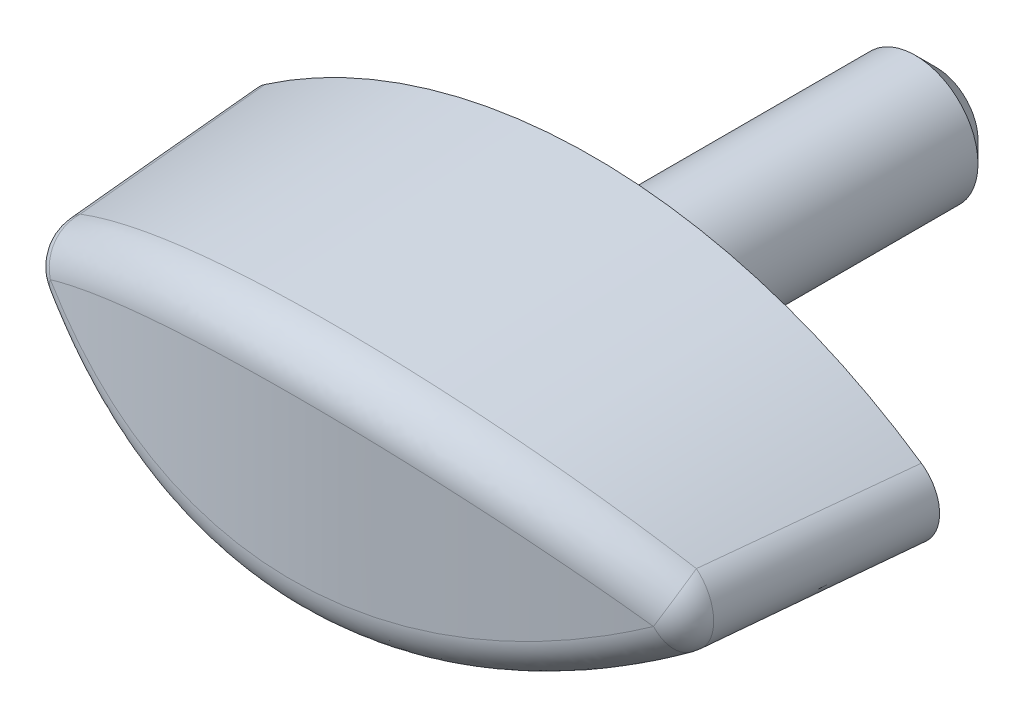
ISO-10303-21;
HEADER;
FILE_DESCRIPTION(('STEP AP214'),'2;1');
FILE_NAME('part.step','',(''),(''),'','','');
FILE_SCHEMA(('AUTOMOTIVE_DESIGN { 1 0 10303 214 1 1 1 1 }'));
ENDSEC;
DATA;
#1=APPLICATION_CONTEXT('core data for automotive mechanical design processes');
#2=APPLICATION_PROTOCOL_DEFINITION('international standard','automotive_design',2000,#1);
#3=PRODUCT_CONTEXT('',#1,'mechanical');
#4=PRODUCT('Part','Part','',(#3));
#5=PRODUCT_RELATED_PRODUCT_CATEGORY('part','',(#4));
#6=PRODUCT_DEFINITION_FORMATION('','',#4);
#7=PRODUCT_DEFINITION_CONTEXT('part definition',#1,'design');
#8=PRODUCT_DEFINITION('design','',#6,#7);
#9=PRODUCT_DEFINITION_SHAPE('','',#8);
#10=(LENGTH_UNIT() NAMED_UNIT(*) SI_UNIT(.MILLI.,.METRE.));
#11=(NAMED_UNIT(*) PLANE_ANGLE_UNIT() SI_UNIT($,.RADIAN.));
#12=(NAMED_UNIT(*) SI_UNIT($,.STERADIAN.) SOLID_ANGLE_UNIT());
#13=UNCERTAINTY_MEASURE_WITH_UNIT(LENGTH_MEASURE(1.E-05),#10,'distance_accuracy_value','');
#14=(GEOMETRIC_REPRESENTATION_CONTEXT(3) GLOBAL_UNCERTAINTY_ASSIGNED_CONTEXT((#13)) GLOBAL_UNIT_ASSIGNED_CONTEXT((#10,
#11,#12)) REPRESENTATION_CONTEXT('',''));
#15=CARTESIAN_POINT('',(0.,0.,0.));
#16=DIRECTION('',(0.,0.,1.));
#17=DIRECTION('',(1.,0.,0.));
#18=AXIS2_PLACEMENT_3D('',#15,#16,#17);
#19=CARTESIAN_POINT('',(-0.00046056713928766,-21.3,0.4));
#20=DIRECTION('',(0.,0.,-1.));
#21=DIRECTION('',(1.,0.,0.));
#22=AXIS2_PLACEMENT_3D('',#19,#20,#21);
#23=CONICAL_SURFACE('',#22,27.8,0.05235987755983);
#24=CARTESIAN_POINT('',(-0.00046056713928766,-21.3,0.4));
#25=DIRECTION('',(0.,0.,1.));
#26=DIRECTION('',(1.,0.,0.));
#27=AXIS2_PLACEMENT_3D('',#24,#25,#26);
#28=CIRCLE('',#27,27.8);
#29=CARTESIAN_POINT('',(15.6901745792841,1.6487247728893,0.4));
#30=VERTEX_POINT('',#29);
#31=CARTESIAN_POINT('',(-15.6910957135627,1.6487247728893,0.4));
#32=VERTEX_POINT('',#31);
#33=EDGE_CURVE('E235',#30,#32,#28,.T.);
#34=ORIENTED_EDGE('',*,*,#33,.T.);
#35=CARTESIAN_POINT('',(-14.153359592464,1.70103457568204,15.5404933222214));
#36=CARTESIAN_POINT('',(-15.0967597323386,1.11474020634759,15.6348374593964));
#37=CARTESIAN_POINT('',(-15.0967597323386,0.,15.6348374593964));
#38=CARTESIAN_POINT('',(-15.0967597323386,-1.11474020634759,15.6348374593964));
#39=CARTESIAN_POINT('',(-14.153359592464,-1.70103457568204,15.5404933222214));
#40=CARTESIAN_POINT('',(-14.3318556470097,1.69502029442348,13.8532547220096));
#41=CARTESIAN_POINT('',(-15.2654012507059,1.10725885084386,13.9484266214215));
#42=CARTESIAN_POINT('',(-15.2656662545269,0.,13.9457595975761));
#43=CARTESIAN_POINT('',(-15.2654012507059,-1.10725885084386,13.9484266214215));
#44=CARTESIAN_POINT('',(-14.3318556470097,-1.69502029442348,13.8532547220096));
#45=CARTESIAN_POINT('',(-14.5077422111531,1.68906895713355,12.1657858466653));
#46=CARTESIAN_POINT('',(-15.4319944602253,1.09998107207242,12.2590737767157));
#47=CARTESIAN_POINT('',(-15.4322394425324,0.,12.2565551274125));
#48=CARTESIAN_POINT('',(-15.4319944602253,-1.09998107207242,12.2590737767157));
#49=CARTESIAN_POINT('',(-14.5077422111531,-1.68906895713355,12.1657858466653));
#50=CARTESIAN_POINT('',(-14.8547932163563,1.67728860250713,8.79045641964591));
#51=CARTESIAN_POINT('',(-15.7609233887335,1.08581921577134,8.88044733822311));
#52=CARTESIAN_POINT('',(-15.7611684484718,0.,8.87793247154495));
#53=CARTESIAN_POINT('',(-15.7609233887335,-1.08581921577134,8.88044733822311));
#54=CARTESIAN_POINT('',(-14.8547932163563,-1.67728860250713,8.79045641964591));
#55=CARTESIAN_POINT('',(-15.0259577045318,1.6714595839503,7.10259587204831));
#56=CARTESIAN_POINT('',(-15.9233017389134,1.07893267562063,7.19086597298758));
#57=CARTESIAN_POINT('',(-15.9235243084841,0.,7.18851428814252));
#58=CARTESIAN_POINT('',(-15.9233017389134,-1.07893267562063,7.19086597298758));
#59=CARTESIAN_POINT('',(-15.0259577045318,-1.6714595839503,7.10259587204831));
#60=CARTESIAN_POINT('',(-15.6389500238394,1.6505385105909,0.981728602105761));
#61=CARTESIAN_POINT('',(-16.5038593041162,1.0546564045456,1.07851891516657));
#62=CARTESIAN_POINT('',(-16.5054048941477,0.,1.06226832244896));
#63=CARTESIAN_POINT('',(-16.5038593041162,-1.0546564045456,1.07851891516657));
#64=CARTESIAN_POINT('',(-15.6389500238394,-1.6505385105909,0.981728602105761));
#65=CARTESIAN_POINT('',(-16.0683322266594,1.63579618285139,-3.45232904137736));
#66=CARTESIAN_POINT('',(-16.9125731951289,1.03822558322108,-3.36118159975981));
#67=CARTESIAN_POINT('',(-16.9138312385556,0.,-3.37517244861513));
#68=CARTESIAN_POINT('',(-16.9125731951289,-1.03822558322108,-3.36118159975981));
#69=CARTESIAN_POINT('',(-16.0683322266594,-1.63579618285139,-3.45232904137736));
#70=CARTESIAN_POINT('',(-16.9043767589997,1.60706856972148,-12.3222655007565));
#71=CARTESIAN_POINT('',(-17.7092403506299,1.00727593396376,-12.2373342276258));
#72=CARTESIAN_POINT('',(-17.7104809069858,0.,-12.2511817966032));
#73=CARTESIAN_POINT('',(-17.7092403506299,-1.00727593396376,-12.2373342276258));
#74=CARTESIAN_POINT('',(-16.9043767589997,-1.60706856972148,-12.3222655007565));
#75=CARTESIAN_POINT('',(-17.3110389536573,1.59308328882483,-16.7581443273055));
#76=CARTESIAN_POINT('',(-18.0976673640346,0.99273181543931,-16.6776440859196));
#77=CARTESIAN_POINT('',(-18.0987041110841,0.,-16.6897503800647));
#78=CARTESIAN_POINT('',(-18.0976673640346,-0.99273181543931,-16.6776440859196));
#79=CARTESIAN_POINT('',(-17.3110389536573,-1.59308328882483,-16.7581443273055));
#80=CARTESIAN_POINT('',(-18.1060525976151,1.56581345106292,-25.63153463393));
#81=CARTESIAN_POINT('',(-18.8578714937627,0.965180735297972,-25.5559824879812));
#82=CARTESIAN_POINT('',(-18.8589022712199,0.,-25.5680225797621));
#83=CARTESIAN_POINT('',(-18.8578714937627,-0.965180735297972,-25.5559824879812));
#84=CARTESIAN_POINT('',(-18.1060525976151,-1.56581345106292,-25.63153463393));
#85=CARTESIAN_POINT('',(-18.4944030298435,1.55252893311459,-30.0690461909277));
#86=CARTESIAN_POINT('',(-19.2300008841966,0.952156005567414,-29.9970959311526));
#87=CARTESIAN_POINT('',(-19.2308763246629,0.,-30.0077262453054));
#88=CARTESIAN_POINT('',(-19.2300008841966,-0.952156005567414,-29.9970959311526));
#89=CARTESIAN_POINT('',(-18.4944030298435,-1.55252893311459,-30.0690461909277));
#90=CARTESIAN_POINT('',(-19.0655893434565,1.53309045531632,-36.7261060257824));
#91=CARTESIAN_POINT('',(-19.7785728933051,0.933545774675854,-36.6651612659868));
#92=CARTESIAN_POINT('',(-19.778789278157,0.,-36.6677969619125));
#93=CARTESIAN_POINT('',(-19.7785728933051,-0.933545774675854,-36.6651612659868));
#94=CARTESIAN_POINT('',(-19.0655893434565,-1.53309045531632,-36.7261060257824));
#95=CARTESIAN_POINT('',(-19.2540937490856,1.52669238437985,-38.9452441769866));
#96=CARTESIAN_POINT('',(-19.959549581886,0.927505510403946,-38.8853995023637));
#97=CARTESIAN_POINT('',(-19.9597511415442,0.,-38.8878925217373));
#98=CARTESIAN_POINT('',(-19.959549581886,-0.927505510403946,-38.8853995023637));
#99=CARTESIAN_POINT('',(-19.2540937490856,-1.52669238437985,-38.9452441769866));
#100=CARTESIAN_POINT('',(-19.6276330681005,1.51405317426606,-43.3837667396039));
#101=CARTESIAN_POINT('',(-20.3184015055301,0.915713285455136,-43.325766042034));
#102=CARTESIAN_POINT('',(-20.3186020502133,0.,-43.3282485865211));
#103=CARTESIAN_POINT('',(-20.3184015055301,-0.915713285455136,-43.325766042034));
#104=CARTESIAN_POINT('',(-19.6276330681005,-1.51405317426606,-43.3837667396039));
#105=CARTESIAN_POINT('',(-19.8126679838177,1.50781203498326,-45.6031511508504));
#106=CARTESIAN_POINT('',(-20.4963068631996,0.909959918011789,-45.5461814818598));
#107=CARTESIAN_POINT('',(-20.4964910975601,0.,-45.5485090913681));
#108=CARTESIAN_POINT('',(-20.4963068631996,-0.909959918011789,-45.5461814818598));
#109=CARTESIAN_POINT('',(-19.8126679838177,-1.50781203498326,-45.6031511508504));
#110=CARTESIAN_POINT('',(-19.9961229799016,1.50164645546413,-47.8226466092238));
#111=CARTESIAN_POINT('',(-20.6729817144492,0.904332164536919,-47.7688455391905));
#112=CARTESIAN_POINT('',(-20.6729817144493,0.,-47.7688455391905));
#113=CARTESIAN_POINT('',(-20.6729817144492,-0.904332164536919,-47.7688455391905));
#114=CARTESIAN_POINT('',(-19.9961229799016,-1.50164645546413,-47.8226466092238));
#115=(BOUNDED_SURFACE() B_SPLINE_SURFACE(3,2,((#35,#36,#37,#38,#39),(#40,#41,#42,#43,#44),(#45,
#46,#47,#48,#49),(#50,#51,#52,#53,#54),(#55,#56,#57,#58,#59),(#60,#61,#62,#63,#64),(#65,#66,#67,
#68,#69),(#70,#71,#72,#73,#74),(#75,#76,#77,#78,#79),(#80,#81,#82,#83,#84),(#85,#86,#87,#88,
#89),(#90,#91,#92,#93,#94),(#95,#96,#97,#98,#99),(#100,#101,#102,#103,#104),(#105,#106,#107,
#108,#109),(#110,#111,#112,#113,#114)),.UNSPECIFIED.,.F.,.F.,
.F.) B_SPLINE_SURFACE_WITH_KNOTS((4,2,2,2,2,2,2,4),(3,2,3),(0.,5.08695661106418,
10.1738624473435,23.5321935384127,36.8906039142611,50.2497553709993,56.9292475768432,
63.6087352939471),(0.,0.5,1.),
.UNSPECIFIED.) GEOMETRIC_REPRESENTATION_ITEM() RATIONAL_B_SPLINE_SURFACE(((1.,0.873483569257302,
1.,0.873483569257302,1.),(1.,0.874875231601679,1.,0.874875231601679,1.),(1.,0.876222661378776,
1.,0.876222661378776,1.),(1.,0.878837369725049,1.,0.878837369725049,1.),(1.,0.880104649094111,
1.,0.880104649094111,1.),(1.,0.884569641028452,1.,0.884569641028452,1.),(1.,0.887555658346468,
1.,0.887555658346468,1.),(1.,0.893140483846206,1.,0.893140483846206,1.),(1.,0.895739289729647,
1.,0.895739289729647,1.),(1.,0.90062485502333,1.,0.90062485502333,1.),(1.,0.902911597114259,1.,
0.902911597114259,1.),(1.,0.906149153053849,1.,0.906149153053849,1.),(1.,0.907196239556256,1.,
0.907196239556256,1.),(1.,0.909231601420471,1.,0.909231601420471,1.),(1.,0.9102198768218,1.,
0.9102198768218,1.),(1.,0.911181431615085,1.,0.911181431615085,1.))) REPRESENTATION_ITEM('') SURFACE());
#116=CARTESIAN_POINT('',(-19.9961229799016,1.50164645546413,-47.8226466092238));
#117=CARTESIAN_POINT('',(-19.8126679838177,1.50781203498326,-45.6031511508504));
#118=CARTESIAN_POINT('',(-19.6276330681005,1.51405317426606,-43.3837667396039));
#119=CARTESIAN_POINT('',(-19.2540937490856,1.52669238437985,-38.9452441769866));
#120=CARTESIAN_POINT('',(-19.0655893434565,1.53309045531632,-36.7261060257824));
#121=CARTESIAN_POINT('',(-18.4944030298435,1.55252893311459,-30.0690461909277));
#122=CARTESIAN_POINT('',(-18.1060525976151,1.56581345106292,-25.63153463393));
#123=CARTESIAN_POINT('',(-17.3110389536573,1.59308328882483,-16.7581443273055));
#124=CARTESIAN_POINT('',(-16.9043767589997,1.60706856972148,-12.3222655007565));
#125=CARTESIAN_POINT('',(-16.0683322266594,1.63579618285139,-3.45232904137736));
#126=CARTESIAN_POINT('',(-15.6389500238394,1.6505385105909,0.98172860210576));
#127=CARTESIAN_POINT('',(-15.0259577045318,1.6714595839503,7.10259587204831));
#128=CARTESIAN_POINT('',(-14.8547932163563,1.67728860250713,8.7904564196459));
#129=CARTESIAN_POINT('',(-14.5077422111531,1.68906895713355,12.1657858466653));
#130=CARTESIAN_POINT('',(-14.3318556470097,1.69502029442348,13.8532547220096));
#131=CARTESIAN_POINT('',(-14.153359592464,1.70103457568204,15.5404933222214));
#132=B_SPLINE_CURVE_WITH_KNOTS('',3,(#116,#117,#118,#119,#120,#121,#122,#123,#124,#125,#126,
#127,#128,#129,#130,#131),.UNSPECIFIED.,.F.,.F.,(4,2,2,2,2,2,2,4),(0.,6.67948771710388,
13.3589799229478,26.718131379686,40.0765417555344,53.4348728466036,58.5217786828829,
63.6087352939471),.UNSPECIFIED.);
#133=CARTESIAN_POINT('',(-14.7065623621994,1.6823200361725,10.2319467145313));
#134=VERTEX_POINT('',#133);
#135=EDGE_CURVE('E185',#32,#134,#132,.T.);
#136=ORIENTED_EDGE('',*,*,#135,.T.);
#137=CARTESIAN_POINT('',(-20.0811536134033,-4.41765469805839,9.05919102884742));
#138=CARTESIAN_POINT('',(-20.794375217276,-3.4970775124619,8.61347525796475));
#139=CARTESIAN_POINT('',(-20.5149823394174,-3.09184561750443,7.46781532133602));
#140=CARTESIAN_POINT('',(-19.815137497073,-4.14625680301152,9.22543510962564));
#141=CARTESIAN_POINT('',(-20.5308171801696,-3.20305312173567,8.78645329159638));
#142=CARTESIAN_POINT('',(-20.2437516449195,-2.79870414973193,7.62525685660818));
#143=CARTESIAN_POINT('',(-19.5427558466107,-3.88016952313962,9.39104448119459));
#144=CARTESIAN_POINT('',(-20.2613659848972,-2.91519162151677,8.95855393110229));
#145=CARTESIAN_POINT('',(-19.9659982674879,-2.51127069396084,7.78209729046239));
#146=CARTESIAN_POINT('',(-18.9853591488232,-3.35883373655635,9.72006316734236));
#147=CARTESIAN_POINT('',(-19.7089688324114,-2.34984852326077,9.30130522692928));
#148=CARTESIAN_POINT('',(-19.3975413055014,-1.94806022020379,8.09369459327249));
#149=CARTESIAN_POINT('',(-18.700343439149,-3.10358579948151,9.88347236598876));
#150=CARTESIAN_POINT('',(-19.4258932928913,-2.07241226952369,9.47196402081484));
#151=CARTESIAN_POINT('',(-19.1068370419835,-1.67228381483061,8.24845135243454));
#152=CARTESIAN_POINT('',(-17.8259485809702,-2.35396683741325,10.3693030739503));
#153=CARTESIAN_POINT('',(-18.5525101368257,-1.25251492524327,9.98255871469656));
#154=CARTESIAN_POINT('',(-18.214886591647,-0.862303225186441,8.70855755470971));
#155=CARTESIAN_POINT('',(-17.2177574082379,-1.8762677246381,10.6869893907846));
#156=CARTESIAN_POINT('',(-17.9443331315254,-0.729523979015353,10.3169263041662));
#157=CARTESIAN_POINT('',(-17.5943489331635,-0.346038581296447,9.00942253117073));
#158=CARTESIAN_POINT('',(-15.9491742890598,-0.965762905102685,11.3040494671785));
#159=CARTESIAN_POINT('',(-16.6701568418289,0.273374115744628,10.9703683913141));
#160=CARTESIAN_POINT('',(-16.2997263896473,0.638135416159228,9.59380956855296));
#161=CARTESIAN_POINT('',(-15.2884707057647,-0.533266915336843,11.6032917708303));
#162=CARTESIAN_POINT('',(-16.0031357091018,0.752117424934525,11.2889684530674));
#163=CARTESIAN_POINT('',(-15.6253216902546,1.1057110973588,9.87720713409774));
#164=CARTESIAN_POINT('',(-13.9208675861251,0.279150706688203,12.1737233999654));
#165=CARTESIAN_POINT('',(-14.6152521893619,1.65761638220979,11.9005576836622));
#166=CARTESIAN_POINT('',(-14.2290764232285,1.98415563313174,10.4174346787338));
#167=CARTESIAN_POINT('',(-13.2139942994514,0.659101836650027,12.4449284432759));
#168=CARTESIAN_POINT('',(-13.8940627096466,2.08328537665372,12.1929547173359));
#169=CARTESIAN_POINT('',(-13.5072628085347,2.3950563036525,10.6742795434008));
#170=CARTESIAN_POINT('',(-11.9037976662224,1.29127459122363,12.9012003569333));
#171=CARTESIAN_POINT('',(-12.5513754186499,2.79582931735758,12.6879484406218));
#172=CARTESIAN_POINT('',(-12.169137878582,3.07881265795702,11.106392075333));
#173=CARTESIAN_POINT('',(-11.3082180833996,1.55381959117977,13.092624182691));
#174=CARTESIAN_POINT('',(-11.937530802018,3.09343963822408,12.8968627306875));
#175=CARTESIAN_POINT('',(-11.5607814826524,3.36281474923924,11.2876801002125));
#176=CARTESIAN_POINT('',(-10.0920972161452,2.03992330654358,13.4495175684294));
#177=CARTESIAN_POINT('',(-10.6779261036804,3.64779713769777,13.2887861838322));
#178=CARTESIAN_POINT('',(-10.3184198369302,3.88869405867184,11.6256761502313));
#179=CARTESIAN_POINT('',(-9.47156072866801,2.26348947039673,13.6149920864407));
#180=CARTESIAN_POINT('',(-10.0325856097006,3.90376958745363,13.4712796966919));
#181=CARTESIAN_POINT('',(-9.68441951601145,4.13057932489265,11.7823888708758));
#182=CARTESIAN_POINT('',(-8.21085725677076,2.66837293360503,13.9161644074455));
#183=CARTESIAN_POINT('',(-8.71506821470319,4.37008842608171,13.8054592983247));
#184=CARTESIAN_POINT('',(-8.39623064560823,4.56867140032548,12.0676142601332));
#185=CARTESIAN_POINT('',(-7.57076855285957,2.84983870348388,14.0519667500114));
#186=CARTESIAN_POINT('',(-8.04373214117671,4.57980517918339,13.9567055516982));
#187=CARTESIAN_POINT('',(-7.74212254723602,4.76503873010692,12.1962259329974));
#188=CARTESIAN_POINT('',(-6.27276490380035,3.16913872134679,14.2916144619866));
#189=CARTESIAN_POINT('',(-6.67611405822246,4.95084987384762,14.2251405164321));
#190=CARTESIAN_POINT('',(-6.41558263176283,5.1105777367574,12.4231844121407));
#191=CARTESIAN_POINT('',(-5.6148541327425,3.30698309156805,14.3954672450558));
#192=CARTESIAN_POINT('',(-5.98095824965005,5.11144433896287,14.3418059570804));
#193=CARTESIAN_POINT('',(-5.74315510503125,5.25976036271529,12.5215382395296));
#194=CARTESIAN_POINT('',(-4.469550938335,3.50526400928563,14.5449044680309));
#195=CARTESIAN_POINT('',(-4.76699841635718,5.34334265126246,14.5103840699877));
#196=CARTESIAN_POINT('',(-4.57251302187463,5.47435769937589,12.663062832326));
#197=CARTESIAN_POINT('',(-3.98527879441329,3.57656511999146,14.5986601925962));
#198=CARTESIAN_POINT('',(-4.25248577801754,5.42691580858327,14.5711789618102));
#199=CARTESIAN_POINT('',(-4.07750634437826,5.55152868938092,12.7139722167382));
#200=CARTESIAN_POINT('',(-3.01174289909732,3.69472517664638,14.6875554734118));
#201=CARTESIAN_POINT('',(-3.21589634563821,5.56575349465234,14.6720040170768));
#202=CARTESIAN_POINT('',(-3.08236136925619,5.67941760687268,12.798160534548));
#203=CARTESIAN_POINT('',(-2.52247966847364,3.74158664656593,14.7226969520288));
#204=CARTESIAN_POINT('',(-2.69445046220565,5.62084543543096,14.7119082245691));
#205=CARTESIAN_POINT('',(-2.58222360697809,5.7301382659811,12.8314412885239));
#206=CARTESIAN_POINT('',(-1.54056281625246,3.81050009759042,14.7739283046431));
#207=CARTESIAN_POINT('',(-1.64628256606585,5.70198847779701,14.7702334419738));
#208=CARTESIAN_POINT('',(-1.57846523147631,5.80472574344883,12.8799599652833));
#209=CARTESIAN_POINT('',(-1.04790652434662,3.83252956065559,14.7900008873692));
#210=CARTESIAN_POINT('',(-1.12024397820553,5.72790625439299,14.7885569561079));
#211=CARTESIAN_POINT('',(-1.07484187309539,5.82856818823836,12.8951815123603));
#212=CARTESIAN_POINT('',(-0.0619125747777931,3.85152073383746,14.8028268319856));
#213=CARTESIAN_POINT('',(-0.0664657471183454,5.75020151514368,14.8032709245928));
#214=CARTESIAN_POINT('',(-0.0668941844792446,5.84911822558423,12.907328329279));
#215=CARTESIAN_POINT('',(0.431424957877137,3.84848655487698,14.799583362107));
#216=CARTESIAN_POINT('',(0.460560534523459,5.74655453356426,14.7996444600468));
#217=CARTESIAN_POINT('',(0.437430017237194,5.84583026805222,12.9042565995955));
#218=CARTESIAN_POINT('',(1.60255721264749,3.81150451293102,14.768936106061));
#219=CARTESIAN_POINT('',(1.71175123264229,5.70275305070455,14.7649470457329));
#220=CARTESIAN_POINT('',(1.63463358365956,5.80579033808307,12.8752321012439));
#221=CARTESIAN_POINT('',(2.27978109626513,3.76633440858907,14.7328856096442));
#222=CARTESIAN_POINT('',(2.43402260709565,5.64946733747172,14.7241316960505));
#223=CARTESIAN_POINT('',(2.32692566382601,5.75689079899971,12.8410904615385));
#224=CARTESIAN_POINT('',(3.62612133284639,3.62923557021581,14.6250252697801));
#225=CARTESIAN_POINT('',(3.86899032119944,5.48787530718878,14.6019758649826));
#226=CARTESIAN_POINT('',(3.70317371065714,5.60848345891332,12.7389412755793));
#227=CARTESIAN_POINT('',(4.295235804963,3.53729619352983,14.5532072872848));
#228=CARTESIAN_POINT('',(4.57997445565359,5.37995560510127,14.5209239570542));
#229=CARTESIAN_POINT('',(4.38712774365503,5.50896413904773,12.6709260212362));
#230=CARTESIAN_POINT('',(5.620453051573,3.30807293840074,14.3754561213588));
#231=CARTESIAN_POINT('',(5.98551056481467,5.11135398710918,14.3206149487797));
#232=CARTESIAN_POINT('',(5.74165729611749,5.26085961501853,12.5025866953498));
#233=CARTESIAN_POINT('',(6.27654930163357,3.17076690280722,14.2695062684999));
#234=CARTESIAN_POINT('',(6.67861072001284,4.95125521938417,14.2017864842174));
#235=CARTESIAN_POINT('',(6.41222610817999,5.11225043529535,12.4022468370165));
#236=CARTESIAN_POINT('',(7.57081563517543,2.85284943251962,14.0258788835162));
#237=CARTESIAN_POINT('',(8.04198725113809,4.58157504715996,13.9292868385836));
#238=CARTESIAN_POINT('',(7.73493729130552,4.76818970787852,12.1715194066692));
#239=CARTESIAN_POINT('',(8.20898646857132,2.67223981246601,13.8882026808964));
#240=CARTESIAN_POINT('',(8.71115884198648,4.37273579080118,13.7761497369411));
#241=CARTESIAN_POINT('',(8.38708043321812,4.57274012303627,12.0411330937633));
#242=CARTESIAN_POINT('',(9.45972662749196,2.27134461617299,13.5849607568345));
#243=CARTESIAN_POINT('',(10.018010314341,3.91078956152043,13.4400567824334));
#244=CARTESIAN_POINT('',(9.66507796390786,4.13894650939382,11.7539476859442));
#245=CARTESIAN_POINT('',(10.0724307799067,2.05131346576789,13.4195742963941));
#246=CARTESIAN_POINT('',(10.6550893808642,3.6587567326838,13.2578452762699));
#247=CARTESIAN_POINT('',(10.2910709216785,3.90087755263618,11.5973183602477));
#248=CARTESIAN_POINT('',(11.2734423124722,1.57331508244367,13.063501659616));
#249=CARTESIAN_POINT('',(11.8988735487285,3.11342074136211,12.8671751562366));
#250=CARTESIAN_POINT('',(11.5179880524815,3.38374983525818,11.2600996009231));
#251=CARTESIAN_POINT('',(11.861749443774,1.31534746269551,12.8728152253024));
#252=CARTESIAN_POINT('',(12.5051806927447,2.82087015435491,12.6592205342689));
#253=CARTESIAN_POINT('',(12.1189119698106,3.10469065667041,11.0795099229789));
#254=CARTESIAN_POINT('',(13.0124178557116,0.763585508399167,12.4692690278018));
#255=CARTESIAN_POINT('',(13.6860353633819,2.19779571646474,12.2210884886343));
#256=CARTESIAN_POINT('',(13.2941017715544,2.50788863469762,10.6973313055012));
#257=CARTESIAN_POINT('',(13.5747438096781,0.469744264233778,12.2563802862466));
#258=CARTESIAN_POINT('',(14.2604369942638,1.86790212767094,11.9913089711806));
#259=CARTESIAN_POINT('',(13.8683313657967,2.19009514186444,10.4957149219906));
#260=CARTESIAN_POINT('',(14.6709415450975,-0.151187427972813,11.8121448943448));
#261=CARTESIAN_POINT('',(15.3754021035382,1.17378101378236,11.5140037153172));
#262=CARTESIAN_POINT('',(14.9875696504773,1.51863734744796,10.0750015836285));
#263=CARTESIAN_POINT('',(15.2048097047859,-0.478282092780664,11.5807959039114));
#264=CARTESIAN_POINT('',(15.9160811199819,0.810131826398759,11.2668068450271));
#265=CARTESIAN_POINT('',(15.5325746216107,1.16496849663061,9.85590241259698));
#266=CARTESIAN_POINT('',(16.3010347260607,-1.2020925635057,11.076437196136));
#267=CARTESIAN_POINT('',(17.0209453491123,0.0093402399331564,10.7306608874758));
#268=CARTESIAN_POINT('',(16.6514893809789,0.38246399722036,9.37824925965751));
#269=CARTESIAN_POINT('',(16.859863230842,-1.60250195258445,10.8016660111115));
#270=CARTESIAN_POINT('',(17.5821760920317,-0.431467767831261,10.4400241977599));
#271=CARTESIAN_POINT('',(17.2217772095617,-0.0503529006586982,9.11802707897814));
#272=CARTESIAN_POINT('',(17.93940530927,-2.43944703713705,10.2387860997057));
#273=CARTESIAN_POINT('',(18.6616083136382,-1.34884391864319,9.84744151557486));
#274=CARTESIAN_POINT('',(18.3232481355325,-0.954885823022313,8.58495139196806));
#275=CARTESIAN_POINT('',(18.4601120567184,-2.87598917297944,9.95067499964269));
#276=CARTESIAN_POINT('',(19.1803900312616,-1.82496232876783,9.54563233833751));
#277=CARTESIAN_POINT('',(18.8544242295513,-1.42660878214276,8.31209563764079));
#278=CARTESIAN_POINT('',(19.4601451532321,-3.78132024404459,9.36761594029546));
#279=CARTESIAN_POINT('',(20.172691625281,-2.80841975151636,8.93752577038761));
#280=CARTESIAN_POINT('',(19.8743614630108,-2.40473038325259,7.75990928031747));
#281=CARTESIAN_POINT('',(19.9396415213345,-4.24996077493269,9.07270313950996));
#282=CARTESIAN_POINT('',(20.647062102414,-3.31530887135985,8.63125476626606));
#283=CARTESIAN_POINT('',(20.3632969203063,-2.91096939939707,7.4806119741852));
#284=CARTESIAN_POINT('',(20.6287720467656,-4.97711707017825,8.62854705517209));
#285=CARTESIAN_POINT('',(21.3283507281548,-4.10131871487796,8.17047222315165));
#286=CARTESIAN_POINT('',(21.0658500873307,-3.69632587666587,7.05997374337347));
#287=CARTESIAN_POINT('',(20.8534327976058,-5.22349757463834,8.48021886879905));
#288=CARTESIAN_POINT('',(21.5494719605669,-4.36633664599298,8.01734695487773));
#289=CARTESIAN_POINT('',(21.2948618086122,-3.96240386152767,6.91949946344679));
#290=CARTESIAN_POINT('',(21.2926427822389,-5.7242705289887,8.18366278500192));
#291=CARTESIAN_POINT('',(21.9810585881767,-4.90404357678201,7.71178627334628));
#292=CARTESIAN_POINT('',(21.7425310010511,-4.50316520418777,6.63864588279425));
#293=CARTESIAN_POINT('',(21.507191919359,-5.97866305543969,8.03543488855));
#294=CARTESIAN_POINT('',(22.1916197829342,-5.17672868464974,7.55932336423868));
#295=CARTESIAN_POINT('',(21.9611883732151,-4.77784864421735,6.49826658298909));
#296=CARTESIAN_POINT('',(21.7166323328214,-6.23702325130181,7.887613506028));
#297=CARTESIAN_POINT('',(22.3974453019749,-5.45401421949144,7.40710811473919));
#298=CARTESIAN_POINT('',(22.1746166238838,-5.05679182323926,6.35827227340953));
#299=(BOUNDED_SURFACE() B_SPLINE_SURFACE(3,2,((#137,#138,#139),(#140,#141,#142),(#143,#144,
#145),(#146,#147,#148),(#149,#150,#151),(#152,#153,#154),(#155,#156,#157),(#158,#159,#160),
(#161,#162,#163),(#164,#165,#166),(#167,#168,#169),(#170,#171,#172),(#173,#174,#175),(#176,#177,
#178),(#179,#180,#181),(#182,#183,#184),(#185,#186,#187),(#188,#189,#190),(#191,#192,#193),
(#194,#195,#196),(#197,#198,#199),(#200,#201,#202),(#203,#204,#205),(#206,#207,#208),(#209,#210,
#211),(#212,#213,#214),(#215,#216,#217),(#218,#219,#220),(#221,#222,#223),(#224,#225,#226),
(#227,#228,#229),(#230,#231,#232),(#233,#234,#235),(#236,#237,#238),(#239,#240,#241),(#242,#243,
#244),(#245,#246,#247),(#248,#249,#250),(#251,#252,#253),(#254,#255,#256),(#257,#258,#259),
(#260,#261,#262),(#263,#264,#265),(#266,#267,#268),(#269,#270,#271),(#272,#273,#274),(#275,#276,
#277),(#278,#279,#280),(#281,#282,#283),(#284,#285,#286),(#287,#288,#289),(#290,#291,#292),
(#293,#294,#295),(#296,#297,#298)),.UNSPECIFIED.,.F.,.F.,.F.) B_SPLINE_SURFACE_WITH_KNOTS((4,2,
2,2,2,2,2,2,2,2,2,2,2,2,2,2,2,2,2,2,2,2,2,2,2,2,4),(3,3),(0.,1.20698527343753,2.41403389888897,
4.8305598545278,7.26268570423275,9.6934406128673,11.6356284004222,13.5774446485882,
15.5123051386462,17.4467163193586,18.8465647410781,20.2462685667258,21.6472406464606,
23.0479829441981,24.9767574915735,26.9059711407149,28.8361284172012,30.7662048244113,
32.6842460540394,34.6023068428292,36.522903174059,38.4437433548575,40.580186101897,
42.7170104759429,44.844547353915,45.9080071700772,46.9714771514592),(0.,1.),
.UNSPECIFIED.) GEOMETRIC_REPRESENTATION_ITEM() RATIONAL_B_SPLINE_SURFACE(((1.,0.848585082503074,
1.),(1.,0.845596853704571,1.),(1.,0.842576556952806,1.),(1.,0.836489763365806,1.),(1.,
0.833423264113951,1.),(1.,0.82417564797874,1.),(1.,0.817952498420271,1.),(1.,0.805532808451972,
1.),(1.,0.79933669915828,1.),(1.,0.787223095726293,1.),(1.,0.781305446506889,1.),(1.,
0.771122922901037,1.),(1.,0.766764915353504,1.),(1.,0.758508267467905,1.),(1.,0.754609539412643,
1.),(1.,0.747416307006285,1.),(1.,0.744119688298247,1.),(1.,0.738238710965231,1.),(1.,
0.735654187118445,1.),(1.,0.731904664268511,1.),(1.,0.730544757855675,1.),(1.,0.728284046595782,
1.),(1.,0.727383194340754,1.),(1.,0.72606162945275,1.),(1.,0.72564135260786,1.),(1.,
0.725292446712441,1.),(1.,0.725363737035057,1.),(1.,0.726116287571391,1.),(1.,0.727017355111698,
1.),(1.,0.729709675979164,1.),(1.,0.731501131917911,1.),(1.,0.735896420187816,1.),(1.,
0.738500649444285,1.),(1.,0.74441421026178,1.),(1.,0.747723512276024,1.),(1.,0.754900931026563,
1.),(1.,0.75876543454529,1.),(1.,0.766940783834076,1.),(1.,0.771251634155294,1.),(1.,
0.780199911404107,1.),(1.,0.784837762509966,1.),(1.,0.794317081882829,1.),(1.,0.799158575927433,
1.),(1.,0.809486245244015,1.),(1.,0.814983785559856,1.),(1.,0.825966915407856,1.),(1.,
0.831452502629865,1.),(1.,0.842274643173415,1.),(1.,0.847611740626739,1.),(1.,0.855448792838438,
1.),(1.,0.858032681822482,1.),(1.,0.863134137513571,1.),(1.,0.865651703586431,1.),(1.,
0.868130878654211,1.))) REPRESENTATION_ITEM('') SURFACE());
#300=CARTESIAN_POINT('',(-20.5149823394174,-3.09184561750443,7.46781532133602));
#301=CARTESIAN_POINT('',(-20.2437516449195,-2.79870414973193,7.62525685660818));
#302=CARTESIAN_POINT('',(-19.9659982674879,-2.51127069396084,7.78209729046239));
#303=CARTESIAN_POINT('',(-19.3975413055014,-1.94806022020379,8.09369459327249));
#304=CARTESIAN_POINT('',(-19.1068370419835,-1.67228381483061,8.24845135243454));
#305=CARTESIAN_POINT('',(-18.214886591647,-0.862303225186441,8.70855755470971));
#306=CARTESIAN_POINT('',(-17.5943489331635,-0.346038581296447,9.00942253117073));
#307=CARTESIAN_POINT('',(-16.2997263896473,0.638135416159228,9.59380956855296));
#308=CARTESIAN_POINT('',(-15.6253216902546,1.1057110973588,9.87720713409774));
#309=CARTESIAN_POINT('',(-14.2290764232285,1.98415563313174,10.4174346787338));
#310=CARTESIAN_POINT('',(-13.5072628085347,2.3950563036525,10.6742795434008));
#311=CARTESIAN_POINT('',(-12.169137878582,3.07881265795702,11.106392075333));
#312=CARTESIAN_POINT('',(-11.5607814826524,3.36281474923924,11.2876801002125));
#313=CARTESIAN_POINT('',(-10.3184198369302,3.88869405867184,11.6256761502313));
#314=CARTESIAN_POINT('',(-9.68441951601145,4.13057932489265,11.7823888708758));
#315=CARTESIAN_POINT('',(-8.39623064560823,4.56867140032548,12.0676142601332));
#316=CARTESIAN_POINT('',(-7.74212254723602,4.76503873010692,12.1962259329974));
#317=CARTESIAN_POINT('',(-6.41558263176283,5.1105777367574,12.4231844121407));
#318=CARTESIAN_POINT('',(-5.74315510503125,5.25976036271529,12.5215382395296));
#319=CARTESIAN_POINT('',(-4.57251302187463,5.47435769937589,12.663062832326));
#320=CARTESIAN_POINT('',(-4.07750634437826,5.55152868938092,12.7139722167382));
#321=CARTESIAN_POINT('',(-3.08236136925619,5.67941760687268,12.798160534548));
#322=CARTESIAN_POINT('',(-2.58222360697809,5.7301382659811,12.8314412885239));
#323=CARTESIAN_POINT('',(-1.57846523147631,5.80472574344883,12.8799599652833));
#324=CARTESIAN_POINT('',(-1.07484187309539,5.82856818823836,12.8951815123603));
#325=CARTESIAN_POINT('',(-0.0668941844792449,5.84911822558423,12.907328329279));
#326=CARTESIAN_POINT('',(0.437430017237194,5.84583026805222,12.9042565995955));
#327=CARTESIAN_POINT('',(1.63463358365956,5.80579033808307,12.8752321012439));
#328=CARTESIAN_POINT('',(2.32692566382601,5.75689079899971,12.8410904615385));
#329=CARTESIAN_POINT('',(3.70317371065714,5.60848345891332,12.7389412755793));
#330=CARTESIAN_POINT('',(4.38712774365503,5.50896413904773,12.6709260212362));
#331=CARTESIAN_POINT('',(5.74165729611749,5.26085961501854,12.5025866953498));
#332=CARTESIAN_POINT('',(6.41222610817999,5.11225043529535,12.4022468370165));
#333=CARTESIAN_POINT('',(7.73493729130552,4.76818970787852,12.1715194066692));
#334=CARTESIAN_POINT('',(8.38708043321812,4.57274012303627,12.0411330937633));
#335=CARTESIAN_POINT('',(9.66507796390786,4.13894650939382,11.7539476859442));
#336=CARTESIAN_POINT('',(10.2910709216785,3.90087755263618,11.5973183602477));
#337=CARTESIAN_POINT('',(11.5179880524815,3.38374983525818,11.2600996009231));
#338=CARTESIAN_POINT('',(12.1189119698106,3.10469065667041,11.0795099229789));
#339=CARTESIAN_POINT('',(13.2941017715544,2.50788863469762,10.6973313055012));
#340=CARTESIAN_POINT('',(13.8683313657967,2.19009514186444,10.4957149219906));
#341=CARTESIAN_POINT('',(14.9875696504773,1.51863734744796,10.0750015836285));
#342=CARTESIAN_POINT('',(15.5325746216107,1.16496849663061,9.85590241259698));
#343=CARTESIAN_POINT('',(16.6514893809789,0.382463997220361,9.3782492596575));
#344=CARTESIAN_POINT('',(17.2217772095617,-0.0503529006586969,9.11802707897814));
#345=CARTESIAN_POINT('',(18.3232481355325,-0.954885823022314,8.58495139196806));
#346=CARTESIAN_POINT('',(18.8544242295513,-1.42660878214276,8.31209563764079));
#347=CARTESIAN_POINT('',(19.8743614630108,-2.40473038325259,7.75990928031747));
#348=CARTESIAN_POINT('',(20.3632969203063,-2.91096939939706,7.4806119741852));
#349=CARTESIAN_POINT('',(21.0658500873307,-3.69632587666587,7.05997374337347));
#350=CARTESIAN_POINT('',(21.2948618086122,-3.96240386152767,6.91949946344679));
#351=CARTESIAN_POINT('',(21.7425310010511,-4.50316520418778,6.63864588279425));
#352=CARTESIAN_POINT('',(21.9611883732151,-4.77784864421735,6.49826658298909));
#353=CARTESIAN_POINT('',(22.1746166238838,-5.05679182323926,6.35827227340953));
#354=B_SPLINE_CURVE_WITH_KNOTS('',3,(#300,#301,#302,#303,#304,#305,#306,#307,#308,#309,#310,
#311,#312,#313,#314,#315,#316,#317,#318,#319,#320,#321,#322,#323,#324,#325,#326,#327,#328,#329,
#330,#331,#332,#333,#334,#335,#336,#337,#338,#339,#340,#341,#342,#343,#344,#345,#346,#347,#348,
#349,#350,#351,#352,#353),.UNSPECIFIED.,.F.,.F.,(4,2,2,2,2,2,2,2,2,2,2,2,2,2,2,2,2,2,2,2,2,2,2,
2,2,2,4),(0.,1.20698527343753,2.41403389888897,4.8305598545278,7.26268570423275,9.6934406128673,
11.6356284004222,13.5774446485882,15.5123051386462,17.4467163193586,18.8465647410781,
20.2462685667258,21.6472406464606,23.0479829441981,24.9767574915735,26.9059711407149,
28.8361284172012,30.7662048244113,32.6842460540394,34.6023068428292,36.522903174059,
38.4437433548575,40.580186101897,42.7170104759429,44.844547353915,45.9080071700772,
46.9714771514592),.UNSPECIFIED.);
#355=CARTESIAN_POINT('',(14.7112145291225,1.68213078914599,10.1776618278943));
#356=VERTEX_POINT('',#355);
#357=EDGE_CURVE('E72',#134,#356,#354,.T.);
#358=ORIENTED_EDGE('',*,*,#357,.T.);
#359=CARTESIAN_POINT('',(14.1562950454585,-1.70090463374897,15.5040368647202));
#360=CARTESIAN_POINT('',(15.0994880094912,-1.11457832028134,15.5983412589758));
#361=CARTESIAN_POINT('',(15.0994880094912,0.,15.5983412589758));
#362=CARTESIAN_POINT('',(15.0994880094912,1.11457832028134,15.5983412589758));
#363=CARTESIAN_POINT('',(14.1562950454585,1.70090463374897,15.5040368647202));
#364=CARTESIAN_POINT('',(14.3346959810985,-1.69489318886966,13.8173363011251));
#365=CARTESIAN_POINT('',(15.2680418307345,-1.10710248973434,13.9124675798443));
#366=CARTESIAN_POINT('',(15.2683064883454,0.,13.9098035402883));
#367=CARTESIAN_POINT('',(15.2680418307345,1.10710248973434,13.9124675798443));
#368=CARTESIAN_POINT('',(14.3346959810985,1.69489318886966,13.8173363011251));
#369=CARTESIAN_POINT('',(14.5104911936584,-1.68894463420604,12.1304058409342));
#370=CARTESIAN_POINT('',(15.4345503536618,-1.09982994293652,12.22365530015));
#371=CARTESIAN_POINT('',(15.4347950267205,0.,12.2211393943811));
#372=CARTESIAN_POINT('',(15.4345503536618,1.09982994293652,12.22365530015));
#373=CARTESIAN_POINT('',(14.5104911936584,1.68894463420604,12.1304058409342));
#374=CARTESIAN_POINT('',(14.8573660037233,-1.67716974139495,8.75615384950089));
#375=CARTESIAN_POINT('',(15.7633158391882,-1.08567800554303,8.84610978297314));
#376=CARTESIAN_POINT('',(15.7635605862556,0.,8.84359767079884));
#377=CARTESIAN_POINT('',(15.7633158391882,1.08567800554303,8.84610978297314));
#378=CARTESIAN_POINT('',(14.8573660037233,1.67716974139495,8.75615384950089));
#379=CARTESIAN_POINT('',(15.0284456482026,-1.67134340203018,7.06883232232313));
#380=CARTESIAN_POINT('',(15.9256153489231,-1.07879615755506,7.15706930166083));
#381=CARTESIAN_POINT('',(15.9258376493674,0.,7.15472009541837));
#382=CARTESIAN_POINT('',(15.9256153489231,1.07879615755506,7.15706930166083));
#383=CARTESIAN_POINT('',(15.0284456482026,1.67134340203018,7.06883232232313));
#384=CARTESIAN_POINT('',(15.6412826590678,-1.65042700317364,0.948498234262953));
#385=CARTESIAN_POINT('',(16.5060318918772,-1.05453037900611,1.04525528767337));
#386=CARTESIAN_POINT('',(16.5075766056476,0.,1.02901136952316));
#387=CARTESIAN_POINT('',(16.5060318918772,1.05453037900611,1.04525528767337));
#388=CARTESIAN_POINT('',(15.6412826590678,1.65042700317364,0.948498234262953));
#389=CARTESIAN_POINT('',(16.0706012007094,-1.63568664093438,-3.48556450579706));
#390=CARTESIAN_POINT('',(16.914688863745,-1.03810484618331,-3.39444681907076));
#391=CARTESIAN_POINT('',(16.9159462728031,0.,-3.40843243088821));
#392=CARTESIAN_POINT('',(16.914688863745,1.03810484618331,-3.39444681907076));
#393=CARTESIAN_POINT('',(16.0706012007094,1.63568664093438,-3.48556450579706));
#394=CARTESIAN_POINT('',(16.9065313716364,-1.60696281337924,-12.3555098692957));
#395=CARTESIAN_POINT('',(17.7112542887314,-1.00716466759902,-12.2706047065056));
#396=CARTESIAN_POINT('',(17.7124942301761,0.,-12.2844471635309));
#397=CARTESIAN_POINT('',(17.7112542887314,1.00716466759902,-12.2706047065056));
#398=CARTESIAN_POINT('',(16.9065313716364,1.60696281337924,-12.3555098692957));
#399=CARTESIAN_POINT('',(17.3131428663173,-1.5929793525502,-16.7913925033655));
#400=CARTESIAN_POINT('',(18.0996361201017,-0.992624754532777,-16.7109159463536));
#401=CARTESIAN_POINT('',(18.1006724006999,0.,-16.7230181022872));
#402=CARTESIAN_POINT('',(18.0996361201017,0.992624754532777,-16.7109159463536));
#403=CARTESIAN_POINT('',(17.3131428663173,1.5929793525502,-16.7913925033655));
#404=CARTESIAN_POINT('',(18.1080644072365,-1.56571302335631,-25.6647892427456));
#405=CARTESIAN_POINT('',(18.859758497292,-0.965081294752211,-25.5892582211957));
#406=CARTESIAN_POINT('',(18.8607888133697,0.,-25.6012942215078));
#407=CARTESIAN_POINT('',(18.859758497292,0.965081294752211,-25.5892582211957));
#408=CARTESIAN_POINT('',(18.1080644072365,1.56571302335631,-25.6647892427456));
#409=CARTESIAN_POINT('',(18.4963734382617,-1.55243019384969,-30.1023034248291));
#410=CARTESIAN_POINT('',(19.2318510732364,-0.952059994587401,-30.0303725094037));
#411=CARTESIAN_POINT('',(19.2327261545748,0.,-30.0409994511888));
#412=CARTESIAN_POINT('',(19.2318510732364,0.952059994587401,-30.0303725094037));
#413=CARTESIAN_POINT('',(18.4963734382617,1.55243019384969,-30.1023034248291));
#414=CARTESIAN_POINT('',(19.0675028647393,-1.53299415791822,-36.7593667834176));
#415=CARTESIAN_POINT('',(19.7803723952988,-0.93345448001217,-36.6984374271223));
#416=CARTESIAN_POINT('',(19.7805886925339,0.,-36.7010722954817));
#417=CARTESIAN_POINT('',(19.7803723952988,0.93345448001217,-36.6984374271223));
#418=CARTESIAN_POINT('',(19.0675028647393,1.53299415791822,-36.7593667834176));
#419=CARTESIAN_POINT('',(19.2559891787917,-1.52659688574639,-38.9785060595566));
#420=CARTESIAN_POINT('',(19.9613330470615,-0.927415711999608,-38.9186762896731));
#421=CARTESIAN_POINT('',(19.961534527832,0.,-38.9211685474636));
#422=CARTESIAN_POINT('',(19.9613330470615,0.927415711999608,-38.9186762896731));
#423=CARTESIAN_POINT('',(19.2559891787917,1.52659688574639,-38.9785060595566));
#424=CARTESIAN_POINT('',(19.6294938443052,-1.51395924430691,-43.4170307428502));
#425=CARTESIAN_POINT('',(20.3201542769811,-0.915626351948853,-43.3590441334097));
#426=CARTESIAN_POINT('',(20.3203547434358,0.,-43.3615259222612));
#427=CARTESIAN_POINT('',(20.3201542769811,0.915626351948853,-43.3590441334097));
#428=CARTESIAN_POINT('',(19.6294938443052,1.51395924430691,-43.4170307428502));
#429=CARTESIAN_POINT('',(19.814512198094,-1.50771887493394,-45.6364161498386));
#430=CARTESIAN_POINT('',(20.4980449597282,-0.909874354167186,-45.5794601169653));
#431=CARTESIAN_POINT('',(20.498229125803,0.,-45.5817870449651));
#432=CARTESIAN_POINT('',(20.4980449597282,0.909874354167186,-45.5794601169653));
#433=CARTESIAN_POINT('',(19.814512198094,1.50771887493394,-45.6364161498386));
#434=CARTESIAN_POINT('',(19.9979512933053,-1.50155405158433,-47.8559125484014));
#435=CARTESIAN_POINT('',(20.6747056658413,-0.904247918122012,-47.8021240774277));
#436=CARTESIAN_POINT('',(20.6747056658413,0.,-47.8021240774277));
#437=CARTESIAN_POINT('',(20.6747056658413,0.904247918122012,-47.8021240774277));
#438=CARTESIAN_POINT('',(19.9979512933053,1.50155405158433,-47.8559125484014));
#439=(BOUNDED_SURFACE() B_SPLINE_SURFACE(3,2,((#359,#360,#361,#362,#363),(#364,#365,#366,#367,
#368),(#369,#370,#371,#372,#373),(#374,#375,#376,#377,#378),(#379,#380,#381,#382,#383),(#384,
#385,#386,#387,#388),(#389,#390,#391,#392,#393),(#394,#395,#396,#397,#398),(#399,#400,#401,#402,
#403),(#404,#405,#406,#407,#408),(#409,#410,#411,#412,#413),(#414,#415,#416,#417,#418),(#419,
#420,#421,#422,#423),(#424,#425,#426,#427,#428),(#429,#430,#431,#432,#433),(#434,#435,#436,#437,
#438)),.UNSPECIFIED.,.F.,.F.,.F.) B_SPLINE_SURFACE_WITH_KNOTS((4,2,2,2,2,2,2,4),(3,2,3),(0.,
5.08532431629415,10.1705979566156,23.528928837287,36.8873388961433,50.2464890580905,
56.9259807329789,63.605467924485),(0.,0.5,1.),
.UNSPECIFIED.) GEOMETRIC_REPRESENTATION_ITEM() RATIONAL_B_SPLINE_SURFACE(((1.,0.873513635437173,
1.,0.873513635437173,1.),(1.,0.874904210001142,1.,0.874904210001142,1.),(1.,0.876250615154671,
1.,0.876250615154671,1.),(1.,0.878863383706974,1.,0.878863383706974,1.),(1.,0.880129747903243,
1.,0.880129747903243,1.),(1.,0.884592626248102,1.,0.884592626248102,1.),(1.,0.887577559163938,
1.,0.887577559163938,1.),(1.,0.893160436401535,1.,0.893160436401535,1.),(1.,0.895758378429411,
1.,0.895758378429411,1.),(1.,0.90064237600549,1.,0.90064237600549,1.),(1.,0.902928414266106,1.,
0.902928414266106,1.),(1.,0.906165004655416,1.,0.906165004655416,1.),(1.,0.907211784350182,1.,
0.907211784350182,1.),(1.,0.90924655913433,1.,0.90924655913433,1.),(1.,0.910234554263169,1.,
0.910234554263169,1.),(1.,0.911195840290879,1.,0.911195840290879,1.))) REPRESENTATION_ITEM('') SURFACE());
#440=CARTESIAN_POINT('',(14.1562950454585,1.70090463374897,15.5040368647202));
#441=CARTESIAN_POINT('',(14.3346959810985,1.69489318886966,13.8173363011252));
#442=CARTESIAN_POINT('',(14.5104911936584,1.68894463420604,12.1304058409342));
#443=CARTESIAN_POINT('',(14.8573660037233,1.67716974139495,8.75615384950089));
#444=CARTESIAN_POINT('',(15.0284456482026,1.67134340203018,7.06883232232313));
#445=CARTESIAN_POINT('',(15.6412826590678,1.65042700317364,0.948498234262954));
#446=CARTESIAN_POINT('',(16.0706012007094,1.63568664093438,-3.48556450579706));
#447=CARTESIAN_POINT('',(16.9065313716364,1.60696281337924,-12.3555098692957));
#448=CARTESIAN_POINT('',(17.3131428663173,1.5929793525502,-16.7913925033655));
#449=CARTESIAN_POINT('',(18.1080644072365,1.56571302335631,-25.6647892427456));
#450=CARTESIAN_POINT('',(18.4963734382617,1.55243019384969,-30.1023034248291));
#451=CARTESIAN_POINT('',(19.0675028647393,1.53299415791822,-36.7593667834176));
#452=CARTESIAN_POINT('',(19.2559891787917,1.52659688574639,-38.9785060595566));
#453=CARTESIAN_POINT('',(19.6294938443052,1.51395924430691,-43.4170307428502));
#454=CARTESIAN_POINT('',(19.814512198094,1.50771887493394,-45.6364161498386));
#455=CARTESIAN_POINT('',(19.9979512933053,1.50155405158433,-47.8559125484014));
#456=B_SPLINE_CURVE_WITH_KNOTS('',3,(#440,#441,#442,#443,#444,#445,#446,#447,#448,#449,#450,
#451,#452,#453,#454,#455),.UNSPECIFIED.,.F.,.F.,(4,2,2,2,2,2,2,4),(0.,5.08532431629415,
10.1705979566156,23.528928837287,36.8873388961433,50.2464890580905,56.9259807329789,
63.605467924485),.UNSPECIFIED.);
#457=EDGE_CURVE('E95',#356,#30,#456,.T.);
#458=ORIENTED_EDGE('',*,*,#457,.T.);
#459=EDGE_LOOP('',(#34,#136,#358,#458));
#460=FACE_BOUND('',#459,.T.);
#461=ADVANCED_FACE('F14',(#460),#23,.T.);
#462=CARTESIAN_POINT('',(-0.00046056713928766,21.3,0.4));
#463=DIRECTION('',(0.,0.,-1.));
#464=DIRECTION('',(1.,0.,0.));
#465=AXIS2_PLACEMENT_3D('',#462,#463,#464);
#466=CONICAL_SURFACE('',#465,27.8,0.05235987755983);
#467=CARTESIAN_POINT('',(20.0711763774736,4.39496545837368,8.98554703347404));
#468=CARTESIAN_POINT('',(20.7792479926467,3.47446072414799,8.53942960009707));
#469=CARTESIAN_POINT('',(20.4973770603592,3.06756531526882,7.39807074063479));
#470=CARTESIAN_POINT('',(19.8044221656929,4.12351179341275,9.15361619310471));
#471=CARTESIAN_POINT('',(20.5150075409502,3.18036844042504,8.71420532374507));
#472=CARTESIAN_POINT('',(20.2254000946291,2.77436157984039,7.55724071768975));
#473=CARTESIAN_POINT('',(19.5312877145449,3.85738367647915,9.32103468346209));
#474=CARTESIAN_POINT('',(20.2448645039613,2.89245643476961,8.88808179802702));
#475=CARTESIAN_POINT('',(19.9468851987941,2.48688170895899,7.71579447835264));
#476=CARTESIAN_POINT('',(18.9723520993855,3.33599641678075,9.65363716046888));
#477=CARTESIAN_POINT('',(19.6910503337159,2.32703868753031,9.23435637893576));
#478=CARTESIAN_POINT('',(19.3768706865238,1.92361052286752,8.03078581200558));
#479=CARTESIAN_POINT('',(18.6865502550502,3.08073785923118,9.81882102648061));
#480=CARTESIAN_POINT('',(19.4072487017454,2.04957856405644,9.40676269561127));
#481=CARTESIAN_POINT('',(19.0853703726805,1.64781983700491,8.18722327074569));
#482=CARTESIAN_POINT('',(17.8097315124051,2.33112606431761,10.309928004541));
#483=CARTESIAN_POINT('',(18.5315995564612,1.22963003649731,9.92258907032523));
#484=CARTESIAN_POINT('',(18.1909641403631,0.837837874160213,8.65232636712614));
#485=CARTESIAN_POINT('',(17.1998469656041,1.85349242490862,10.6310591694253));
#486=CARTESIAN_POINT('',(17.9218405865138,0.706667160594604,10.2603668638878));
#487=CARTESIAN_POINT('',(17.5687091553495,0.321636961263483,8.95645378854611));
#488=CARTESIAN_POINT('',(15.9276647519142,0.943244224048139,11.2548675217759));
#489=CARTESIAN_POINT('',(16.6442758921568,-0.296070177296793,10.9205218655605));
#490=CARTESIAN_POINT('',(16.2704328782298,-0.662275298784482,9.5472317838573));
#491=CARTESIAN_POINT('',(15.2650518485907,0.510942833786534,11.5574110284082));
#492=CARTESIAN_POINT('',(15.9754380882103,-0.774672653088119,11.2424185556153));
#493=CARTESIAN_POINT('',(15.59408806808,-1.12964925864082,9.83375575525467));
#494=CARTESIAN_POINT('',(13.8934462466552,-0.300890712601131,12.1342282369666));
#495=CARTESIAN_POINT('',(14.5837091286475,-1.67970988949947,11.860420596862));
#496=CARTESIAN_POINT('',(14.1937723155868,-2.00748082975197,10.3800307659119));
#497=CARTESIAN_POINT('',(13.1844802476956,-0.680452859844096,12.4085179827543));
#498=CARTESIAN_POINT('',(13.8604861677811,-2.10505205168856,12.1559271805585));
#499=CARTESIAN_POINT('',(13.4698287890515,-2.41797078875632,10.6397969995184));
#500=CARTESIAN_POINT('',(11.8717740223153,-1.31102657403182,12.8696160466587));
#501=CARTESIAN_POINT('',(12.5154209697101,-2.81601362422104,12.6557631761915));
#502=CARTESIAN_POINT('',(12.1291518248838,-3.10001637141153,11.0764801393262));
#503=CARTESIAN_POINT('',(11.2758775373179,-1.57249409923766,13.0628813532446));
#504=CARTESIAN_POINT('',(11.9013231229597,-3.1125135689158,12.8665158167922));
#505=CARTESIAN_POINT('',(11.5204762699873,-3.3828614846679,11.2595121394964));
#506=CARTESIAN_POINT('',(10.0591290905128,-2.05645798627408,13.4234153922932));
#507=CARTESIAN_POINT('',(10.6412133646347,-3.66467051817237,13.2620914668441));
#508=CARTESIAN_POINT('',(10.277481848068,-3.9064433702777,11.6009560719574));
#509=CARTESIAN_POINT('',(9.43828195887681,-2.27896184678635,13.5906891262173));
#510=CARTESIAN_POINT('',(9.9956198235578,-3.91955361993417,13.446395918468));
#511=CARTESIAN_POINT('',(9.64316794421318,-4.14718824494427,11.7593727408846));
#512=CARTESIAN_POINT('',(8.17697143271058,-2.6817246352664,13.8954120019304));
#513=CARTESIAN_POINT('',(8.67760217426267,-4.38370136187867,13.7841670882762));
#514=CARTESIAN_POINT('',(8.35436561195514,-4.5830039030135,12.0479606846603));
#515=CARTESIAN_POINT('',(7.53658682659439,-2.8621329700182,14.0329664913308));
#516=CARTESIAN_POINT('',(8.00601824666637,-4.59233816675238,13.9371911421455));
#517=CARTESIAN_POINT('',(7.69995815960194,-4.77823621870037,12.178231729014));
#518=CARTESIAN_POINT('',(6.23798656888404,-3.17931342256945,14.2760838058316));
#519=CARTESIAN_POINT('',(6.63788624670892,-4.96122103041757,14.2091639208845));
#520=CARTESIAN_POINT('',(6.37281380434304,-5.12150022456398,12.4084760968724));
#521=CARTESIAN_POINT('',(5.57977513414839,-3.31609576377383,14.3816541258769));
#522=CARTESIAN_POINT('',(5.94246370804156,-5.12073444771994,14.3275849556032));
#523=CARTESIAN_POINT('',(5.70008123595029,-5.26954297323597,12.5084565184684));
#524=CARTESIAN_POINT('',(4.4356763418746,-3.51223605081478,14.5337924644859));
#525=CARTESIAN_POINT('',(4.72986968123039,-5.35040739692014,14.4989082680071));
#526=CARTESIAN_POINT('',(4.53067341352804,-5.48184001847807,12.6525392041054));
#527=CARTESIAN_POINT('',(3.95293516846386,-3.58254806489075,14.5886044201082));
#528=CARTESIAN_POINT('',(4.21701264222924,-5.43294117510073,14.5607718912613));
#529=CARTESIAN_POINT('',(4.03723285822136,-5.55794742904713,12.7044488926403));
#530=CARTESIAN_POINT('',(2.98248649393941,-3.69889418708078,14.6797301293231));
#531=CARTESIAN_POINT('',(3.18376751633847,-5.56989156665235,14.6638731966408));
#532=CARTESIAN_POINT('',(3.04524572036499,-5.68388699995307,12.790749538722));
#533=CARTESIAN_POINT('',(2.49477951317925,-3.74493081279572,14.7160458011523));
#534=CARTESIAN_POINT('',(2.66400363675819,-5.62413755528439,14.7049840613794));
#535=CARTESIAN_POINT('',(2.54669967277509,-5.73372188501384,12.8251423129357));
#536=CARTESIAN_POINT('',(1.5159784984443,-3.81235705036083,14.769748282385));
#537=CARTESIAN_POINT('',(1.61920237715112,-5.70378043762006,14.7658668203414));
#538=CARTESIAN_POINT('',(1.54612776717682,-5.80671371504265,12.8760012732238));
#539=CARTESIAN_POINT('',(1.02488178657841,-3.83372419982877,14.7871178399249));
#540=CARTESIAN_POINT('',(1.0948413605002,-5.72904508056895,14.785539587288));
#541=CARTESIAN_POINT('',(1.04409915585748,-5.82984634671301,12.8924511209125));
#542=CARTESIAN_POINT('',(0.0419881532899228,-3.85154993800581,14.80265916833));
#543=CARTESIAN_POINT('',(0.0443894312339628,-5.75022234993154,14.8030936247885));
#544=CARTESIAN_POINT('',(0.0393212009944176,-5.84914908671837,12.9071695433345));
#545=CARTESIAN_POINT('',(-0.44980864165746,-3.84801256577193,14.8008340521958));
#546=CARTESIAN_POINT('',(-0.480995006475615,-5.74611039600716,14.800955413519));
#547=CARTESIAN_POINT('',(-0.463428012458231,-5.84532356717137,12.9054410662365));
#548=CARTESIAN_POINT('',(-1.61889966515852,-3.80996365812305,14.7736627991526));
#549=CARTESIAN_POINT('',(-1.73004248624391,-5.70135529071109,14.7699142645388));
#550=CARTESIAN_POINT('',(-1.65854575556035,-5.80414572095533,12.8797085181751));
#551=CARTESIAN_POINT('',(-2.29563456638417,-3.76418779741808,14.7396383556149));
#552=CARTESIAN_POINT('',(-2.45182904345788,-5.64752943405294,14.7312253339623));
#553=CARTESIAN_POINT('',(-2.35033900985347,-5.75460026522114,12.8474856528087));
#554=CARTESIAN_POINT('',(-3.64106479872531,-3.62592539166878,14.6358753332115));
#555=CARTESIAN_POINT('',(-3.8859359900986,-5.4849064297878,14.6133677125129));
#556=CARTESIAN_POINT('',(-3.72566002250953,-5.60495285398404,12.7492168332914));
#557=CARTESIAN_POINT('',(-4.30975825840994,-3.53342818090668,14.5661285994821));
#558=CARTESIAN_POINT('',(-4.59654485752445,-5.37649382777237,14.5344798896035));
#559=CARTESIAN_POINT('',(-4.40918585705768,-5.50483935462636,12.6831631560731));
#560=CARTESIAN_POINT('',(-5.63420225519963,-3.30311687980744,14.3925557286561));
#561=CARTESIAN_POINT('',(-6.00143708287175,-5.10692629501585,14.3385250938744));
#562=CARTESIAN_POINT('',(-5.76293046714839,-5.25557613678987,12.5187808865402));
#563=CARTESIAN_POINT('',(-6.28994629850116,-3.16528063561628,14.2887129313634));
#564=CARTESIAN_POINT('',(-6.69426688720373,-4.94635276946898,14.22187988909));
#565=CARTESIAN_POINT('',(-6.43314256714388,-5.10640244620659,12.420436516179));
#566=CARTESIAN_POINT('',(-7.58357185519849,-2.8463119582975,14.0493257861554));
#567=CARTESIAN_POINT('',(-8.05719674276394,-4.57571756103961,13.9537555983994));
#568=CARTESIAN_POINT('',(-7.75520649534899,-4.76122233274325,12.1937248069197));
#569=CARTESIAN_POINT('',(-8.22145412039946,-2.6651813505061,13.91378277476));
#570=CARTESIAN_POINT('',(-8.72618848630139,-4.3663970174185,13.8028050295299));
#571=CARTESIAN_POINT('',(-8.4070590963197,-4.56521788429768,12.0653587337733));
#572=CARTESIAN_POINT('',(-9.47169615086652,-2.26323275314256,13.6148087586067));
#573=CARTESIAN_POINT('',(-10.0327800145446,-3.90345687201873,13.4710644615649));
#574=CARTESIAN_POINT('',(-9.6845573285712,-4.13030171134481,11.7822152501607));
#575=CARTESIAN_POINT('',(-10.0841896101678,-2.04266772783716,13.4515558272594));
#576=CARTESIAN_POINT('',(-10.6697735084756,-3.65090969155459,13.2910134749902));
#577=CARTESIAN_POINT('',(-10.3103403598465,-3.89166348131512,11.6276064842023));
#578=CARTESIAN_POINT('',(-11.2848187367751,-1.5635785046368,13.0997663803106));
#579=CARTESIAN_POINT('',(-11.913436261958,-3.10450212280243,12.9046579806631));
#580=CARTESIAN_POINT('',(-11.5368784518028,-3.37337176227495,11.2944441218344));
#581=CARTESIAN_POINT('',(-11.8729541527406,-1.30505391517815,12.9112296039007));
#582=CARTESIAN_POINT('',(-12.5197030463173,-2.81139498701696,12.6988548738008));
#583=CARTESIAN_POINT('',(-12.1376332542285,-3.09371785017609,11.1158902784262));
#584=CARTESIAN_POINT('',(-13.0233014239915,-0.752145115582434,12.5120037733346));
#585=CARTESIAN_POINT('',(-13.7005022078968,-2.18715607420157,12.2650256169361));
#586=CARTESIAN_POINT('',(-13.3125085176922,-2.49569024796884,10.7378032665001));
#587=CARTESIAN_POINT('',(-13.5854780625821,-0.457714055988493,12.3012858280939));
#588=CARTESIAN_POINT('',(-14.2748846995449,-1.85665580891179,12.0373959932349));
#589=CARTESIAN_POINT('',(-13.8865928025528,-2.17726597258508,10.5382427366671));
#590=CARTESIAN_POINT('',(-14.6813856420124,0.164437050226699,11.8614146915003));
#591=CARTESIAN_POINT('',(-15.3898168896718,-1.16126550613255,11.5643944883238));
#592=CARTESIAN_POINT('',(-15.0055499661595,-1.50450301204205,10.121662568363));
#593=CARTESIAN_POINT('',(-15.2151129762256,0.492161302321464,11.6322591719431));
#594=CARTESIAN_POINT('',(-15.9304788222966,-0.796955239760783,11.3193508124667));
#595=CARTESIAN_POINT('',(-15.5504191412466,-1.15015978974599,9.90464072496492));
#596=CARTESIAN_POINT('',(-16.3105594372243,1.21703506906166,11.1327808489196));
#597=CARTESIAN_POINT('',(-17.0348222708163,0.00495104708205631,10.7879910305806));
#598=CARTESIAN_POINT('',(-16.6685568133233,-0.366518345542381,9.43160954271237));
#599=CARTESIAN_POINT('',(-16.8687794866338,1.61785175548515,10.8607151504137));
#600=CARTESIAN_POINT('',(-17.5955706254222,0.446182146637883,10.5000089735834));
#601=CARTESIAN_POINT('',(-17.2382335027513,0.0667327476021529,9.17394959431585));
#602=CARTESIAN_POINT('',(-17.9471354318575,2.455609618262,10.3033139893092));
#603=CARTESIAN_POINT('',(-18.674065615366,1.3644151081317,9.91278555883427));
#604=CARTESIAN_POINT('',(-18.3385147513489,0.972133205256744,8.64606256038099));
#605=CARTESIAN_POINT('',(-18.4672645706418,2.89255717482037,10.0179761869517));
#606=CARTESIAN_POINT('',(-19.1923889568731,1.84096667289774,9.61368110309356));
#607=CARTESIAN_POINT('',(-18.8691123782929,1.44428943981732,8.3758332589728));
#608=CARTESIAN_POINT('',(-19.4661685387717,3.79870846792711,9.4405129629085));
#609=CARTESIAN_POINT('',(-20.1837929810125,2.82531010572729,9.01101929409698));
#610=CARTESIAN_POINT('',(-19.8879203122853,2.42328899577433,7.82894644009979));
#611=CARTESIAN_POINT('',(-19.9451123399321,4.26776467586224,9.14842219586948));
#612=CARTESIAN_POINT('',(-20.6577207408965,3.33265275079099,8.70748838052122));
#613=CARTESIAN_POINT('',(-20.376303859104,2.92997362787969,7.55232174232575));
#614=CARTESIAN_POINT('',(-20.6334053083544,4.99554004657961,8.70854874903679));
#615=CARTESIAN_POINT('',(-21.3383245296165,4.11934032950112,8.25087323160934));
#616=CARTESIAN_POINT('',(-21.0780209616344,3.71599478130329,7.13573938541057));
#617=CARTESIAN_POINT('',(-20.8577860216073,5.24212682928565,8.56165576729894));
#618=CARTESIAN_POINT('',(-21.5592174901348,4.38458596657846,8.09913841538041));
#619=CARTESIAN_POINT('',(-21.3067532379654,3.98229441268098,6.99662431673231));
#620=CARTESIAN_POINT('',(-21.2964299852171,5.74330865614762,8.26798666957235));
#621=CARTESIAN_POINT('',(-21.9903394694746,4.92274579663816,7.79637310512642));
#622=CARTESIAN_POINT('',(-21.7538576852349,4.52349544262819,6.71850485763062));
#623=CARTESIAN_POINT('',(-21.5106931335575,5.99790378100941,8.12121055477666));
#624=CARTESIAN_POINT('',(-22.2006641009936,5.19565616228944,7.64531529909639));
#625=CARTESIAN_POINT('',(-21.9722297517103,4.79839692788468,6.57950046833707));
#626=CARTESIAN_POINT('',(-21.7198432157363,6.2564636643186,7.97484913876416));
#627=CARTESIAN_POINT('',(-22.4062458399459,5.47316356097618,7.49451745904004));
#628=CARTESIAN_POINT('',(-22.185368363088,5.07755520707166,6.4408888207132));
#629=(BOUNDED_SURFACE() B_SPLINE_SURFACE(3,2,((#467,#468,#469),(#470,#471,#472),(#473,#474,
#475),(#476,#477,#478),(#479,#480,#481),(#482,#483,#484),(#485,#486,#487),(#488,#489,#490),
(#491,#492,#493),(#494,#495,#496),(#497,#498,#499),(#500,#501,#502),(#503,#504,#505),(#506,#507,
#508),(#509,#510,#511),(#512,#513,#514),(#515,#516,#517),(#518,#519,#520),(#521,#522,#523),
(#524,#525,#526),(#527,#528,#529),(#530,#531,#532),(#533,#534,#535),(#536,#537,#538),(#539,#540,
#541),(#542,#543,#544),(#545,#546,#547),(#548,#549,#550),(#551,#552,#553),(#554,#555,#556),
(#557,#558,#559),(#560,#561,#562),(#563,#564,#565),(#566,#567,#568),(#569,#570,#571),(#572,#573,
#574),(#575,#576,#577),(#578,#579,#580),(#581,#582,#583),(#584,#585,#586),(#587,#588,#589),
(#590,#591,#592),(#593,#594,#595),(#596,#597,#598),(#599,#600,#601),(#602,#603,#604),(#605,#606,
#607),(#608,#609,#610),(#611,#612,#613),(#614,#615,#616),(#617,#618,#619),(#620,#621,#622),
(#623,#624,#625),(#626,#627,#628)),.UNSPECIFIED.,.F.,.F.,.F.) B_SPLINE_SURFACE_WITH_KNOTS((4,2,
2,2,2,2,2,2,2,2,2,2,2,2,2,2,2,2,2,2,2,2,2,2,2,2,4),(3,3),(0.,1.21044756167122,2.42096021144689,
4.84445920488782,7.28372831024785,9.7216045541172,11.6647415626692,13.6075041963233,
15.5432629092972,17.4785676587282,18.8740339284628,20.2693554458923,21.6659464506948,
23.0623109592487,24.9895378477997,26.9172048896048,28.8458152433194,30.7743442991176,
32.690919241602,34.6075139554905,36.5266366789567,38.4460021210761,40.5790545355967,
42.7124844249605,44.83669627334,45.8984997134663,46.9603138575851),(0.,1.),
.UNSPECIFIED.) GEOMETRIC_REPRESENTATION_ITEM() RATIONAL_B_SPLINE_SURFACE(((1.,0.849127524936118,
1.),(1.,0.846126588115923,1.),(1.,0.843093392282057,1.),(1.,0.836980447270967,1.),(1.,
0.833900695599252,1.),(1.,0.824612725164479,1.),(1.,0.818361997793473,1.),(1.,0.80588601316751,
1.),(1.,0.799661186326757,1.),(1.,0.787490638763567,1.),(1.,0.781544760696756,1.),(1.,
0.771324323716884,1.),(1.,0.766955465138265,1.),(1.,0.758676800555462,1.),(1.,0.754766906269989,
1.),(1.,0.747551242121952,1.),(1.,0.744243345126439,1.),(1.,0.738339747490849,1.),(1.,
0.735743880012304,1.),(1.,0.731980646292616,1.),(1.,0.73061679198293,1.),(1.,0.728344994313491,
1.),(1.,0.727437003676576,1.),(1.,0.726097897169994,1.),(1.,0.725667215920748,1.),(1.,
0.725294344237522,1.),(1.,0.725352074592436,1.),(1.,0.726069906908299,1.),(1.,0.726950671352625,
1.),(1.,0.729601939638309,1.),(1.,0.731372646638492,1.),(1.,0.735726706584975,1.),(1.,
0.738310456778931,1.),(1.,0.744183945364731,1.),(1.,0.747473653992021,1.),(1.,0.754613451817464,
1.),(1.,0.758459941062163,1.),(1.,0.766600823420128,1.),(1.,0.770895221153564,1.),(1.,
0.779812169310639,1.),(1.,0.784435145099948,1.),(1.,0.793886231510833,1.),(1.,0.798714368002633,
1.),(1.,0.809010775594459,1.),(1.,0.814490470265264,1.),(1.,0.825439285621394,1.),(1.,
0.830908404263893,1.),(1.,0.841699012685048,1.),(1.,0.847021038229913,1.),(1.,0.854836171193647,
1.),(1.,0.857412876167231,1.),(1.,0.862500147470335,1.),(1.,0.865010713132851,1.),(1.,
0.867482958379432,1.))) REPRESENTATION_ITEM('') SURFACE());
#630=CARTESIAN_POINT('',(20.4973770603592,3.06756531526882,7.39807074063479));
#631=CARTESIAN_POINT('',(20.2254000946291,2.77436157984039,7.55724071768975));
#632=CARTESIAN_POINT('',(19.9468851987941,2.48688170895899,7.71579447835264));
#633=CARTESIAN_POINT('',(19.3768706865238,1.92361052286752,8.03078581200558));
#634=CARTESIAN_POINT('',(19.0853703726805,1.64781983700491,8.18722327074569));
#635=CARTESIAN_POINT('',(18.1909641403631,0.837837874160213,8.65232636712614));
#636=CARTESIAN_POINT('',(17.5687091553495,0.321636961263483,8.95645378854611));
#637=CARTESIAN_POINT('',(16.2704328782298,-0.662275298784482,9.5472317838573));
#638=CARTESIAN_POINT('',(15.59408806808,-1.12964925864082,9.83375575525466));
#639=CARTESIAN_POINT('',(14.1937723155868,-2.00748082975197,10.3800307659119));
#640=CARTESIAN_POINT('',(13.4698287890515,-2.41797078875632,10.6397969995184));
#641=CARTESIAN_POINT('',(12.1291518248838,-3.10001637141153,11.0764801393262));
#642=CARTESIAN_POINT('',(11.5204762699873,-3.3828614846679,11.2595121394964));
#643=CARTESIAN_POINT('',(10.277481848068,-3.9064433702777,11.6009560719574));
#644=CARTESIAN_POINT('',(9.64316794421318,-4.14718824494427,11.7593727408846));
#645=CARTESIAN_POINT('',(8.35436561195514,-4.5830039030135,12.0479606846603));
#646=CARTESIAN_POINT('',(7.69995815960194,-4.77823621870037,12.178231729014));
#647=CARTESIAN_POINT('',(6.37281380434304,-5.12150022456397,12.4084760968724));
#648=CARTESIAN_POINT('',(5.70008123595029,-5.26954297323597,12.5084565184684));
#649=CARTESIAN_POINT('',(4.53067341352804,-5.48184001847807,12.6525392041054));
#650=CARTESIAN_POINT('',(4.03723285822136,-5.55794742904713,12.7044488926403));
#651=CARTESIAN_POINT('',(3.04524572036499,-5.68388699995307,12.790749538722));
#652=CARTESIAN_POINT('',(2.54669967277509,-5.73372188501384,12.8251423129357));
#653=CARTESIAN_POINT('',(1.54612776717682,-5.80671371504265,12.8760012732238));
#654=CARTESIAN_POINT('',(1.04409915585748,-5.82984634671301,12.8924511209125));
#655=CARTESIAN_POINT('',(0.0393212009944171,-5.84914908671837,12.9071695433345));
#656=CARTESIAN_POINT('',(-0.463428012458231,-5.84532356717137,12.9054410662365));
#657=CARTESIAN_POINT('',(-1.65854575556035,-5.80414572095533,12.8797085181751));
#658=CARTESIAN_POINT('',(-2.35033900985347,-5.75460026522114,12.8474856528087));
#659=CARTESIAN_POINT('',(-3.72566002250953,-5.60495285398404,12.7492168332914));
#660=CARTESIAN_POINT('',(-4.40918585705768,-5.50483935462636,12.6831631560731));
#661=CARTESIAN_POINT('',(-5.76293046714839,-5.25557613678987,12.5187808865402));
#662=CARTESIAN_POINT('',(-6.43314256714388,-5.10640244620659,12.420436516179));
#663=CARTESIAN_POINT('',(-7.75520649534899,-4.76122233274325,12.1937248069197));
#664=CARTESIAN_POINT('',(-8.4070590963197,-4.56521788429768,12.0653587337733));
#665=CARTESIAN_POINT('',(-9.6845573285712,-4.13030171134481,11.7822152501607));
#666=CARTESIAN_POINT('',(-10.3103403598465,-3.89166348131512,11.6276064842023));
#667=CARTESIAN_POINT('',(-11.5368784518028,-3.37337176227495,11.2944441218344));
#668=CARTESIAN_POINT('',(-12.1376332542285,-3.09371785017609,11.1158902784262));
#669=CARTESIAN_POINT('',(-13.3125085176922,-2.49569024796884,10.7378032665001));
#670=CARTESIAN_POINT('',(-13.8865928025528,-2.17726597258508,10.5382427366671));
#671=CARTESIAN_POINT('',(-15.0055499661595,-1.50450301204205,10.121662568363));
#672=CARTESIAN_POINT('',(-15.5504191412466,-1.15015978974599,9.90464072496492));
#673=CARTESIAN_POINT('',(-16.6685568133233,-0.366518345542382,9.43160954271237));
#674=CARTESIAN_POINT('',(-17.2382335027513,0.066732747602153,9.17394959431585));
#675=CARTESIAN_POINT('',(-18.3385147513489,0.972133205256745,8.64606256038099));
#676=CARTESIAN_POINT('',(-18.8691123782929,1.44428943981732,8.3758332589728));
#677=CARTESIAN_POINT('',(-19.8879203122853,2.42328899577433,7.82894644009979));
#678=CARTESIAN_POINT('',(-20.376303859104,2.92997362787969,7.55232174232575));
#679=CARTESIAN_POINT('',(-21.0780209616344,3.71599478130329,7.13573938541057));
#680=CARTESIAN_POINT('',(-21.3067532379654,3.98229441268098,6.99662431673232));
#681=CARTESIAN_POINT('',(-21.7538576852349,4.52349544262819,6.71850485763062));
#682=CARTESIAN_POINT('',(-21.9722297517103,4.79839692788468,6.57950046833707));
#683=CARTESIAN_POINT('',(-22.185368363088,5.07755520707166,6.4408888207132));
#684=B_SPLINE_CURVE_WITH_KNOTS('',3,(#630,#631,#632,#633,#634,#635,#636,#637,#638,#639,#640,
#641,#642,#643,#644,#645,#646,#647,#648,#649,#650,#651,#652,#653,#654,#655,#656,#657,#658,#659,
#660,#661,#662,#663,#664,#665,#666,#667,#668,#669,#670,#671,#672,#673,#674,#675,#676,#677,#678,
#679,#680,#681,#682,#683),.UNSPECIFIED.,.F.,.F.,(4,2,2,2,2,2,2,2,2,2,2,2,2,2,2,2,2,2,2,2,2,2,2,
2,2,2,4),(0.,1.21044756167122,2.42096021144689,4.84445920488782,7.28372831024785,
9.7216045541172,11.6647415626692,13.6075041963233,15.5432629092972,17.4785676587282,
18.8740339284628,20.2693554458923,21.6659464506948,23.0623109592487,24.9895378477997,
26.9172048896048,28.8458152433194,30.7743442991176,32.690919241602,34.6075139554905,
36.5266366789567,38.4460021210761,40.5790545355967,42.7124844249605,44.83669627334,
45.8984997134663,46.9603138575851),.UNSPECIFIED.);
#685=CARTESIAN_POINT('',(14.7112145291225,-1.68213078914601,10.1776618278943));
#686=VERTEX_POINT('',#685);
#687=CARTESIAN_POINT('',(-14.7065623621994,-1.6823200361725,10.2319467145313));
#688=VERTEX_POINT('',#687);
#689=EDGE_CURVE('E35',#686,#688,#684,.T.);
#690=ORIENTED_EDGE('',*,*,#689,.T.);
#691=CARTESIAN_POINT('',(-14.153359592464,-1.70103457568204,15.5404933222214));
#692=CARTESIAN_POINT('',(-14.3318556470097,-1.69502029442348,13.8532547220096));
#693=CARTESIAN_POINT('',(-14.5077422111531,-1.68906895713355,12.1657858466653));
#694=CARTESIAN_POINT('',(-14.8547932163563,-1.67728860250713,8.7904564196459));
#695=CARTESIAN_POINT('',(-15.0259577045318,-1.6714595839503,7.10259587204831));
#696=CARTESIAN_POINT('',(-15.6389500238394,-1.6505385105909,0.981728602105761));
#697=CARTESIAN_POINT('',(-16.0683322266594,-1.63579618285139,-3.45232904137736));
#698=CARTESIAN_POINT('',(-16.9043767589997,-1.60706856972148,-12.3222655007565));
#699=CARTESIAN_POINT('',(-17.3110389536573,-1.59308328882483,-16.7581443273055));
#700=CARTESIAN_POINT('',(-18.1060525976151,-1.56581345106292,-25.63153463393));
#701=CARTESIAN_POINT('',(-18.4944030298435,-1.55252893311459,-30.0690461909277));
#702=CARTESIAN_POINT('',(-19.0655893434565,-1.53309045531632,-36.7261060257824));
#703=CARTESIAN_POINT('',(-19.2540937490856,-1.52669238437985,-38.9452441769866));
#704=CARTESIAN_POINT('',(-19.6276330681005,-1.51405317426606,-43.3837667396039));
#705=CARTESIAN_POINT('',(-19.8126679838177,-1.50781203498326,-45.6031511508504));
#706=CARTESIAN_POINT('',(-19.9961229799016,-1.50164645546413,-47.8226466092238));
#707=B_SPLINE_CURVE_WITH_KNOTS('',3,(#691,#692,#693,#694,#695,#696,#697,#698,#699,#700,#701,
#702,#703,#704,#705,#706),.UNSPECIFIED.,.F.,.F.,(4,2,2,2,2,2,2,4),(0.,5.08695661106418,
10.1738624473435,23.5321935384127,36.8906039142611,50.2497553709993,56.9292475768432,
63.6087352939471),.UNSPECIFIED.);
#708=CARTESIAN_POINT('',(-15.6910957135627,-1.6487247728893,0.4));
#709=VERTEX_POINT('',#708);
#710=EDGE_CURVE('E220',#688,#709,#707,.T.);
#711=ORIENTED_EDGE('',*,*,#710,.T.);
#712=CARTESIAN_POINT('',(-0.00046056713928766,21.3,0.4));
#713=DIRECTION('',(0.,0.,1.));
#714=DIRECTION('',(1.,0.,0.));
#715=AXIS2_PLACEMENT_3D('',#712,#713,#714);
#716=CIRCLE('',#715,27.8);
#717=CARTESIAN_POINT('',(15.6901745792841,-1.6487247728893,0.4));
#718=VERTEX_POINT('',#717);
#719=EDGE_CURVE('E92',#709,#718,#716,.T.);
#720=ORIENTED_EDGE('',*,*,#719,.T.);
#721=CARTESIAN_POINT('',(19.9979512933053,-1.50155405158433,-47.8559125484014));
#722=CARTESIAN_POINT('',(19.814512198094,-1.50771887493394,-45.6364161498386));
#723=CARTESIAN_POINT('',(19.6294938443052,-1.51395924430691,-43.4170307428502));
#724=CARTESIAN_POINT('',(19.2559891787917,-1.52659688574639,-38.9785060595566));
#725=CARTESIAN_POINT('',(19.0675028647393,-1.53299415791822,-36.7593667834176));
#726=CARTESIAN_POINT('',(18.4963734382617,-1.55243019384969,-30.1023034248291));
#727=CARTESIAN_POINT('',(18.1080644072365,-1.56571302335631,-25.6647892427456));
#728=CARTESIAN_POINT('',(17.3131428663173,-1.5929793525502,-16.7913925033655));
#729=CARTESIAN_POINT('',(16.9065313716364,-1.60696281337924,-12.3555098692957));
#730=CARTESIAN_POINT('',(16.0706012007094,-1.63568664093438,-3.48556450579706));
#731=CARTESIAN_POINT('',(15.6412826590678,-1.65042700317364,0.94849823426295));
#732=CARTESIAN_POINT('',(15.0284456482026,-1.67134340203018,7.06883232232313));
#733=CARTESIAN_POINT('',(14.8573660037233,-1.67716974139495,8.75615384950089));
#734=CARTESIAN_POINT('',(14.5104911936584,-1.68894463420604,12.1304058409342));
#735=CARTESIAN_POINT('',(14.3346959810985,-1.69489318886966,13.8173363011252));
#736=CARTESIAN_POINT('',(14.1562950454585,-1.70090463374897,15.5040368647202));
#737=B_SPLINE_CURVE_WITH_KNOTS('',3,(#721,#722,#723,#724,#725,#726,#727,#728,#729,#730,#731,
#732,#733,#734,#735,#736),.UNSPECIFIED.,.F.,.F.,(4,2,2,2,2,2,2,4),(0.,6.67948719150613,
13.3589788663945,26.7181290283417,40.076539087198,53.4348699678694,58.5201436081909,
63.605467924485),.UNSPECIFIED.);
#738=EDGE_CURVE('E40',#718,#686,#737,.T.);
#739=ORIENTED_EDGE('',*,*,#738,.T.);
#740=EDGE_LOOP('',(#690,#711,#720,#739));
#741=FACE_BOUND('',#740,.T.);
#742=ADVANCED_FACE('F146',(#741),#466,.T.);
#743=CARTESIAN_POINT('',(-0.00046056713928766,0.,0.4));
#744=DIRECTION('',(0.,0.,1.));
#745=DIRECTION('',(1.,0.,0.));
#746=AXIS2_PLACEMENT_3D('',#743,#744,#745);
#747=PLANE('',#746);
#748=CARTESIAN_POINT('',(-0.00046056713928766,0.,0.4));
#749=DIRECTION('',(0.,0.,1.));
#750=DIRECTION('',(1.,0.,0.));
#751=AXIS2_PLACEMENT_3D('',#748,#749,#750);
#752=CIRCLE('',#751,4.);
#753=CARTESIAN_POINT('',(3.99953943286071,0.,0.4));
#754=VERTEX_POINT('',#753);
#755=EDGE_CURVE('E375',#754,#754,#752,.T.);
#756=ORIENTED_EDGE('',*,*,#755,.T.);
#757=EDGE_LOOP('',(#756));
#758=FACE_BOUND('',#757,.T.);
#759=ORIENTED_EDGE('',*,*,#719,.F.);
#760=CARTESIAN_POINT('',(-15.6910957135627,-1.6487247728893,0.4));
#761=CARTESIAN_POINT('',(-15.7375925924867,-1.61695343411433,0.4));
#762=CARTESIAN_POINT('',(-15.7827413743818,-1.5832126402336,0.4));
#763=CARTESIAN_POINT('',(-15.8700405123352,-1.51205710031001,0.4));
#764=CARTESIAN_POINT('',(-15.9121910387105,-1.47464256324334,0.4));
#765=CARTESIAN_POINT('',(-15.9931758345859,-1.39642106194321,0.4));
#766=CARTESIAN_POINT('',(-16.0320118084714,-1.35561586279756,0.4));
#767=CARTESIAN_POINT('',(-16.1060953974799,-1.27086946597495,0.4));
#768=CARTESIAN_POINT('',(-16.1413430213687,-1.2269282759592,0.4));
#769=CARTESIAN_POINT('',(-16.2080448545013,-1.1362280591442,0.4));
#770=CARTESIAN_POINT('',(-16.2394975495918,-1.08946791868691,0.4));
#771=CARTESIAN_POINT('',(-16.2983370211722,-0.993432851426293,0.4));
#772=CARTESIAN_POINT('',(-16.3257223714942,-0.944157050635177,0.4));
#773=CARTESIAN_POINT('',(-16.3762231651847,-0.84350283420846,0.4));
#774=CARTESIAN_POINT('',(-16.3993413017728,-0.79212576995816,0.4));
#775=CARTESIAN_POINT('',(-16.4411379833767,-0.687574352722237,0.4));
#776=CARTESIAN_POINT('',(-16.4598148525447,-0.6343993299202,0.4));
#777=CARTESIAN_POINT('',(-16.4925806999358,-0.526841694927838,0.4));
#778=CARTESIAN_POINT('',(-16.5066842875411,-0.472463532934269,0.4));
#779=CARTESIAN_POINT('',(-16.5302334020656,-0.362687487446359,0.4));
#780=CARTESIAN_POINT('',(-16.5396773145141,-0.307289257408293,0.4));
#781=CARTESIAN_POINT('',(-16.5538622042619,-0.195903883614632,0.4));
#782=CARTESIAN_POINT('',(-16.5586040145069,-0.13991684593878,0.4));
#783=CARTESIAN_POINT('',(-16.5633192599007,-0.027721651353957,0.4));
#784=CARTESIAN_POINT('',(-16.5632909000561,0.0284865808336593,0.4));
#785=CARTESIAN_POINT('',(-16.5585265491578,0.140543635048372,0.4));
#786=CARTESIAN_POINT('',(-16.5538038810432,0.196393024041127,0.4));
#787=CARTESIAN_POINT('',(-16.5396450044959,0.307511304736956,0.4));
#788=CARTESIAN_POINT('',(-16.5302071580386,0.362779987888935,0.4));
#789=CARTESIAN_POINT('',(-16.5067250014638,0.4723035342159,0.4));
#790=CARTESIAN_POINT('',(-16.4926828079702,0.526558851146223,0.4));
#791=CARTESIAN_POINT('',(-16.4600568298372,0.633706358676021,0.4));
#792=CARTESIAN_POINT('',(-16.4414713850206,0.686598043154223,0.4));
#793=CARTESIAN_POINT('',(-16.3999415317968,0.790647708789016,0.4));
#794=CARTESIAN_POINT('',(-16.3769970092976,0.841805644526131,0.4));
#795=CARTESIAN_POINT('',(-16.3268747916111,0.942009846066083,0.4));
#796=CARTESIAN_POINT('',(-16.299695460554,0.991055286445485,0.4));
#797=CARTESIAN_POINT('',(-16.2121234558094,1.13445263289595,0.4));
#798=CARTESIAN_POINT('',(-16.1456426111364,1.22520088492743,0.4));
#799=CARTESIAN_POINT('',(-16.0161150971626,1.37406694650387,0.4));
#800=CARTESIAN_POINT('',(-15.9560271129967,1.4348065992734,0.4));
#801=CARTESIAN_POINT('',(-15.828696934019,1.5480966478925,0.4));
#802=CARTESIAN_POINT('',(-15.7614630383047,1.60065637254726,0.4));
#803=CARTESIAN_POINT('',(-15.6910957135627,1.6487247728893,0.4));
#804=B_SPLINE_CURVE_WITH_KNOTS('',3,(#760,#761,#762,#763,#764,#765,#766,#767,#768,#769,#770,
#771,#772,#773,#774,#775,#776,#777,#778,#779,#780,#781,#782,#783,#784,#785,#786,#787,#788,#789,
#790,#791,#792,#793,#794,#795,#796,#797,#798,#799,#800,#801,#802,#803),.UNSPECIFIED.,.F.,.F.,(4,
2,2,2,2,2,2,2,2,2,2,2,2,2,2,2,2,2,2,2,2,4),(0.,0.168892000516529,0.337774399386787,
0.506569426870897,0.675364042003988,0.844225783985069,1.01314659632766,1.18196042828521,
1.35083785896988,1.51917036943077,1.687561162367,1.85592212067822,2.02434643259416,
2.1922940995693,2.36030015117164,2.52822907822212,2.69621946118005,2.86421424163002,
3.03227407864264,3.36796187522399,3.62363378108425,3.87901193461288),.UNSPECIFIED.);
#805=EDGE_CURVE('E9',#709,#32,#804,.T.);
#806=ORIENTED_EDGE('',*,*,#805,.T.);
#807=ORIENTED_EDGE('',*,*,#33,.F.);
#808=CARTESIAN_POINT('',(15.6901745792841,1.6487247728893,0.4));
#809=CARTESIAN_POINT('',(15.7366714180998,1.61695339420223,0.4));
#810=CARTESIAN_POINT('',(15.7818201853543,1.58321258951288,0.4));
#811=CARTESIAN_POINT('',(15.8691193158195,1.51205704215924,0.4));
#812=CARTESIAN_POINT('',(15.911269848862,1.47464250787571,0.4));
#813=CARTESIAN_POINT('',(15.9922546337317,1.39642099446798,0.4));
#814=CARTESIAN_POINT('',(16.0310905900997,1.35561578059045,0.4));
#815=CARTESIAN_POINT('',(16.105174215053,1.2708694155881,0.4));
#816=CARTESIAN_POINT('',(16.1404218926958,1.22692827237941,0.4));
#817=CARTESIAN_POINT('',(16.2071237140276,1.13622806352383,0.4));
#818=CARTESIAN_POINT('',(16.2385763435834,1.08946788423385,0.4));
#819=CARTESIAN_POINT('',(16.2974157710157,0.993432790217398,0.4));
#820=CARTESIAN_POINT('',(16.3248011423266,0.944157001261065,0.4));
#821=CARTESIAN_POINT('',(16.3753019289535,0.84350278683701,0.4));
#822=CARTESIAN_POINT('',(16.3984200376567,0.792125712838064,0.4));
#823=CARTESIAN_POINT('',(16.4402167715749,0.687574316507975,0.4));
#824=CARTESIAN_POINT('',(16.4588937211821,0.634399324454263,0.4));
#825=CARTESIAN_POINT('',(16.4916595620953,0.526841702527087,0.4));
#826=CARTESIAN_POINT('',(16.5057630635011,0.472463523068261,0.4));
#827=CARTESIAN_POINT('',(16.5293121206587,0.362687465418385,0.4));
#828=CARTESIAN_POINT('',(16.5387560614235,0.307289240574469,0.4));
#829=CARTESIAN_POINT('',(16.5529409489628,0.195903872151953,0.4));
#830=CARTESIAN_POINT('',(16.55768272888,0.139916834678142,0.4));
#831=CARTESIAN_POINT('',(16.5623980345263,0.0277216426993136,0.4));
#832=CARTESIAN_POINT('',(16.5623697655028,-0.0284865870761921,0.4));
#833=CARTESIAN_POINT('',(16.5576054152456,-0.140543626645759,0.4));
#834=CARTESIAN_POINT('',(16.5528826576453,-0.196393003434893,0.4));
#835=CARTESIAN_POINT('',(16.5387237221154,-0.307511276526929,0.4));
#836=CARTESIAN_POINT('',(16.5292859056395,-0.36277996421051,0.4));
#837=CARTESIAN_POINT('',(16.5058037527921,-0.472303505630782,0.4));
#838=CARTESIAN_POINT('',(16.4917615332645,-0.526558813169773,0.4));
#839=CARTESIAN_POINT('',(16.4591356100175,-0.633706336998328,0.4));
#840=CARTESIAN_POINT('',(16.4405502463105,-0.68659804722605,0.4));
#841=CARTESIAN_POINT('',(16.3990204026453,-0.790647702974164,0.4));
#842=CARTESIAN_POINT('',(16.376075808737,-0.841805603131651,0.4));
#843=CARTESIAN_POINT('',(16.3259535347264,-0.942009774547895,0.4));
#844=CARTESIAN_POINT('',(16.298774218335,-0.991055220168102,0.4));
#845=CARTESIAN_POINT('',(16.2112022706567,-1.1344525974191,0.4));
#846=CARTESIAN_POINT('',(16.144721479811,-1.2252008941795,0.4));
#847=CARTESIAN_POINT('',(16.0151939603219,-1.37406693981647,0.4));
#848=CARTESIAN_POINT('',(15.9551059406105,-1.43480655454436,0.4));
#849=CARTESIAN_POINT('',(15.8277757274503,-1.5480965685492,0.4));
#850=CARTESIAN_POINT('',(15.7605418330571,-1.60065629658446,0.4));
#851=CARTESIAN_POINT('',(15.6901745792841,-1.6487247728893,0.4));
#852=B_SPLINE_CURVE_WITH_KNOTS('',3,(#808,#809,#810,#811,#812,#813,#814,#815,#816,#817,#818,
#819,#820,#821,#822,#823,#824,#825,#826,#827,#828,#829,#830,#831,#832,#833,#834,#835,#836,#837,
#838,#839,#840,#841,#842,#843,#844,#845,#846,#847,#848,#849,#850,#851),.UNSPECIFIED.,.F.,.F.,(4,
2,2,2,2,2,2,2,2,2,2,2,2,2,2,2,2,2,2,2,2,4),(0.,0.168891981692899,0.337774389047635,
0.506569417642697,0.675364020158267,0.844225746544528,1.0131465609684,1.18196038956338,
1.35083780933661,1.51917030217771,1.68756109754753,1.85592205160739,2.02434635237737,
2.19229400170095,2.36030005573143,2.52822897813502,2.69621935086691,2.86421411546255,
3.03227395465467,3.36796174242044,3.62363364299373,3.87901179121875),.UNSPECIFIED.);
#853=EDGE_CURVE('E28',#30,#718,#852,.T.);
#854=ORIENTED_EDGE('',*,*,#853,.T.);
#855=EDGE_LOOP('',(#759,#806,#807,#854));
#856=FACE_BOUND('',#855,.T.);
#857=ADVANCED_FACE('F123',(#758,#856),#747,.F.);
#858=CARTESIAN_POINT('',(-0.0636703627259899,-17.2,-22.97221203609));
#859=DIRECTION('',(0.,1.,0.));
#860=DIRECTION('',(0.,0.,1.));
#861=AXIS2_PLACEMENT_3D('',#858,#859,#860);
#862=CYLINDRICAL_SURFACE('',#861,37.7718204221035);
#863=CARTESIAN_POINT('',(-21.7198432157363,6.2564636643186,7.97484913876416));
#864=CARTESIAN_POINT('',(-21.5106931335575,5.99790378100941,8.12121055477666));
#865=CARTESIAN_POINT('',(-21.2964299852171,5.74330865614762,8.26798666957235));
#866=CARTESIAN_POINT('',(-20.8577860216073,5.24212682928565,8.56165576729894));
#867=CARTESIAN_POINT('',(-20.6334053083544,4.99554004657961,8.70854874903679));
#868=CARTESIAN_POINT('',(-19.9451123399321,4.26776467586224,9.14842219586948));
#869=CARTESIAN_POINT('',(-19.4661685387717,3.79870846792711,9.4405129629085));
#870=CARTESIAN_POINT('',(-18.4672645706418,2.89255717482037,10.0179761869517));
#871=CARTESIAN_POINT('',(-17.9471354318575,2.455609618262,10.3033139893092));
#872=CARTESIAN_POINT('',(-16.8687794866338,1.61785175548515,10.8607151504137));
#873=CARTESIAN_POINT('',(-16.3105594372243,1.21703506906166,11.1327808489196));
#874=CARTESIAN_POINT('',(-15.2151129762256,0.492161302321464,11.6322591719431));
#875=CARTESIAN_POINT('',(-14.6813856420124,0.164437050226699,11.8614146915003));
#876=CARTESIAN_POINT('',(-13.5854780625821,-0.457714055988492,12.3012858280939));
#877=CARTESIAN_POINT('',(-13.0233014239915,-0.752145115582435,12.5120037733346));
#878=CARTESIAN_POINT('',(-11.8729541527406,-1.30505391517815,12.9112296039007));
#879=CARTESIAN_POINT('',(-11.2848187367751,-1.5635785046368,13.0997663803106));
#880=CARTESIAN_POINT('',(-10.0841896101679,-2.04266772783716,13.4515558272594));
#881=CARTESIAN_POINT('',(-9.47169615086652,-2.26323275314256,13.6148087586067));
#882=CARTESIAN_POINT('',(-8.22145412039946,-2.6651813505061,13.91378277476));
#883=CARTESIAN_POINT('',(-7.58357185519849,-2.8463119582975,14.0493257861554));
#884=CARTESIAN_POINT('',(-6.28994629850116,-3.16528063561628,14.2887129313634));
#885=CARTESIAN_POINT('',(-5.63420225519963,-3.30311687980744,14.3925557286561));
#886=CARTESIAN_POINT('',(-4.30975825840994,-3.53342818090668,14.5661285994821));
#887=CARTESIAN_POINT('',(-3.64106479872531,-3.62592539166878,14.6358753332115));
#888=CARTESIAN_POINT('',(-2.29563456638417,-3.76418779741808,14.7396383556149));
#889=CARTESIAN_POINT('',(-1.61889966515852,-3.80996365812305,14.7736627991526));
#890=CARTESIAN_POINT('',(-0.44980864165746,-3.84801256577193,14.8008340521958));
#891=CARTESIAN_POINT('',(0.0419881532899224,-3.85154993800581,14.80265916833));
#892=CARTESIAN_POINT('',(1.02488178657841,-3.83372419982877,14.7871178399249));
#893=CARTESIAN_POINT('',(1.5159784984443,-3.81235705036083,14.769748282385));
#894=CARTESIAN_POINT('',(2.49477951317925,-3.74493081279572,14.7160458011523));
#895=CARTESIAN_POINT('',(2.98248649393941,-3.69889418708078,14.6797301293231));
#896=CARTESIAN_POINT('',(3.95293516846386,-3.58254806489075,14.5886044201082));
#897=CARTESIAN_POINT('',(4.4356763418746,-3.51223605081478,14.5337924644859));
#898=CARTESIAN_POINT('',(5.57977513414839,-3.31609576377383,14.3816541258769));
#899=CARTESIAN_POINT('',(6.23798656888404,-3.17931342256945,14.2760838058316));
#900=CARTESIAN_POINT('',(7.53658682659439,-2.8621329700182,14.0329664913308));
#901=CARTESIAN_POINT('',(8.17697143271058,-2.6817246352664,13.8954120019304));
#902=CARTESIAN_POINT('',(9.43828195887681,-2.27896184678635,13.5906891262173));
#903=CARTESIAN_POINT('',(10.0591290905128,-2.05645798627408,13.4234153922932));
#904=CARTESIAN_POINT('',(11.2758775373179,-1.57249409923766,13.0628813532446));
#905=CARTESIAN_POINT('',(11.8717740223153,-1.31102657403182,12.8696160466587));
#906=CARTESIAN_POINT('',(13.1844802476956,-0.680452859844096,12.4085179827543));
#907=CARTESIAN_POINT('',(13.8934462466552,-0.300890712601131,12.1342282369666));
#908=CARTESIAN_POINT('',(15.2650518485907,0.510942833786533,11.5574110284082));
#909=CARTESIAN_POINT('',(15.9276647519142,0.943244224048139,11.2548675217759));
#910=CARTESIAN_POINT('',(17.1998469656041,1.85349242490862,10.6310591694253));
#911=CARTESIAN_POINT('',(17.8097315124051,2.33112606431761,10.309928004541));
#912=CARTESIAN_POINT('',(18.6865502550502,3.08073785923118,9.81882102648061));
#913=CARTESIAN_POINT('',(18.9723520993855,3.33599641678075,9.65363716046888));
#914=CARTESIAN_POINT('',(19.5312877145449,3.85738367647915,9.32103468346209));
#915=CARTESIAN_POINT('',(19.8044221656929,4.12351179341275,9.15361619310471));
#916=CARTESIAN_POINT('',(20.0711763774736,4.39496545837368,8.98554703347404));
#917=B_SPLINE_CURVE_WITH_KNOTS('',3,(#863,#864,#865,#866,#867,#868,#869,#870,#871,#872,#873,
#874,#875,#876,#877,#878,#879,#880,#881,#882,#883,#884,#885,#886,#887,#888,#889,#890,#891,#892,
#893,#894,#895,#896,#897,#898,#899,#900,#901,#902,#903,#904,#905,#906,#907,#908,#909,#910,#911,
#912,#913,#914,#915,#916),.UNSPECIFIED.,.F.,.F.,(4,2,2,2,2,2,2,2,2,2,2,2,2,2,2,2,2,2,2,2,2,2,2,
2,2,2,4),(0.,1.06181414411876,2.12361758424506,4.24782943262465,6.38125932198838,
8.51431173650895,10.4336771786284,12.3527999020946,14.2693946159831,16.1859695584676,
18.1144986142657,20.0431089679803,21.9707760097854,23.8980028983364,25.2943674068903,
26.6909584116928,28.0862799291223,29.4817461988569,31.4170509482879,33.3528096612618,
35.2955722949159,37.2387093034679,39.6765855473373,42.1158546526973,44.5393536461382,
45.7498662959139,46.9603138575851),.UNSPECIFIED.);
#918=CARTESIAN_POINT('',(-14.3885628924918,0.,11.9778648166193));
#919=VERTEX_POINT('',#918);
#920=CARTESIAN_POINT('',(14.4002825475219,0.,11.9205448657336));
#921=VERTEX_POINT('',#920);
#922=EDGE_CURVE('E87',#919,#921,#917,.T.);
#923=ORIENTED_EDGE('',*,*,#922,.T.);
#924=CARTESIAN_POINT('',(21.7166323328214,-6.23702325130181,7.887613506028));
#925=CARTESIAN_POINT('',(21.507191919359,-5.97866305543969,8.03543488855));
#926=CARTESIAN_POINT('',(21.2926427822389,-5.7242705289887,8.18366278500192));
#927=CARTESIAN_POINT('',(20.8534327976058,-5.22349757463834,8.48021886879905));
#928=CARTESIAN_POINT('',(20.6287720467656,-4.97711707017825,8.62854705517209));
#929=CARTESIAN_POINT('',(19.9396415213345,-4.24996077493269,9.07270313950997));
#930=CARTESIAN_POINT('',(19.4601451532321,-3.78132024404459,9.36761594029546));
#931=CARTESIAN_POINT('',(18.4601120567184,-2.87598917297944,9.95067499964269));
#932=CARTESIAN_POINT('',(17.93940530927,-2.43944703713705,10.2387860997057));
#933=CARTESIAN_POINT('',(16.859863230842,-1.60250195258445,10.8016660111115));
#934=CARTESIAN_POINT('',(16.3010347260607,-1.2020925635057,11.076437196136));
#935=CARTESIAN_POINT('',(15.2048097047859,-0.478282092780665,11.5807959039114));
#936=CARTESIAN_POINT('',(14.6709415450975,-0.151187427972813,11.8121448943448));
#937=CARTESIAN_POINT('',(13.5747438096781,0.469744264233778,12.2563802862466));
#938=CARTESIAN_POINT('',(13.0124178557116,0.763585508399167,12.4692690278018));
#939=CARTESIAN_POINT('',(11.861749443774,1.31534746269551,12.8728152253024));
#940=CARTESIAN_POINT('',(11.2734423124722,1.57331508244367,13.063501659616));
#941=CARTESIAN_POINT('',(10.0724307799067,2.05131346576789,13.4195742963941));
#942=CARTESIAN_POINT('',(9.45972662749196,2.27134461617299,13.5849607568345));
#943=CARTESIAN_POINT('',(8.20898646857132,2.67223981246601,13.8882026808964));
#944=CARTESIAN_POINT('',(7.57081563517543,2.85284943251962,14.0258788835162));
#945=CARTESIAN_POINT('',(6.27654930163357,3.17076690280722,14.2695062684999));
#946=CARTESIAN_POINT('',(5.620453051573,3.30807293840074,14.3754561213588));
#947=CARTESIAN_POINT('',(4.295235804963,3.53729619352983,14.5532072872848));
#948=CARTESIAN_POINT('',(3.62612133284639,3.62923557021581,14.6250252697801));
#949=CARTESIAN_POINT('',(2.27978109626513,3.76633440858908,14.7328856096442));
#950=CARTESIAN_POINT('',(1.60255721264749,3.81150451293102,14.768936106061));
#951=CARTESIAN_POINT('',(0.431424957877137,3.84848655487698,14.799583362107));
#952=CARTESIAN_POINT('',(-0.0619125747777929,3.85152073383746,14.8028268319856));
#953=CARTESIAN_POINT('',(-1.04790652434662,3.83252956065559,14.7900008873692));
#954=CARTESIAN_POINT('',(-1.54056281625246,3.81050009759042,14.7739283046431));
#955=CARTESIAN_POINT('',(-2.52247966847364,3.74158664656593,14.7226969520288));
#956=CARTESIAN_POINT('',(-3.01174289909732,3.69472517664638,14.6875554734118));
#957=CARTESIAN_POINT('',(-3.98527879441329,3.57656511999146,14.5986601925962));
#958=CARTESIAN_POINT('',(-4.469550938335,3.50526400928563,14.5449044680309));
#959=CARTESIAN_POINT('',(-5.6148541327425,3.30698309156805,14.3954672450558));
#960=CARTESIAN_POINT('',(-6.27276490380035,3.16913872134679,14.2916144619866));
#961=CARTESIAN_POINT('',(-7.57076855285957,2.84983870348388,14.0519667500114));
#962=CARTESIAN_POINT('',(-8.21085725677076,2.66837293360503,13.9161644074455));
#963=CARTESIAN_POINT('',(-9.47156072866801,2.26348947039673,13.6149920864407));
#964=CARTESIAN_POINT('',(-10.0920972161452,2.03992330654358,13.4495175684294));
#965=CARTESIAN_POINT('',(-11.3082180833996,1.55381959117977,13.092624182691));
#966=CARTESIAN_POINT('',(-11.9037976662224,1.29127459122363,12.9012003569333));
#967=CARTESIAN_POINT('',(-13.2139942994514,0.659101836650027,12.4449284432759));
#968=CARTESIAN_POINT('',(-13.9208675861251,0.279150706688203,12.1737233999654));
#969=CARTESIAN_POINT('',(-15.2884707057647,-0.533266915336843,11.6032917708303));
#970=CARTESIAN_POINT('',(-15.9491742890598,-0.965762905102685,11.3040494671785));
#971=CARTESIAN_POINT('',(-17.2177574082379,-1.8762677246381,10.6869893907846));
#972=CARTESIAN_POINT('',(-17.8259485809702,-2.35396683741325,10.3693030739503));
#973=CARTESIAN_POINT('',(-18.700343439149,-3.10358579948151,9.88347236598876));
#974=CARTESIAN_POINT('',(-18.9853591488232,-3.35883373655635,9.72006316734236));
#975=CARTESIAN_POINT('',(-19.5427558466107,-3.88016952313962,9.39104448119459));
#976=CARTESIAN_POINT('',(-19.815137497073,-4.14625680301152,9.22543510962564));
#977=CARTESIAN_POINT('',(-20.0811536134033,-4.41765469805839,9.05919102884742));
#978=B_SPLINE_CURVE_WITH_KNOTS('',3,(#924,#925,#926,#927,#928,#929,#930,#931,#932,#933,#934,
#935,#936,#937,#938,#939,#940,#941,#942,#943,#944,#945,#946,#947,#948,#949,#950,#951,#952,#953,
#954,#955,#956,#957,#958,#959,#960,#961,#962,#963,#964,#965,#966,#967,#968,#969,#970,#971,#972,
#973,#974,#975,#976,#977),.UNSPECIFIED.,.F.,.F.,(4,2,2,2,2,2,2,2,2,2,2,2,2,2,2,2,2,2,2,2,2,2,2,
2,2,2,4),(0.,1.06346998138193,2.12692979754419,4.25446667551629,6.39129104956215,
8.52773379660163,10.4485739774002,12.36917030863,14.2872310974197,16.2052723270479,
18.135348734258,20.0655060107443,21.9947196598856,23.9234942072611,25.3242365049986,
26.7252085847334,28.124912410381,29.5247608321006,31.4591720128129,33.394032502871,
35.3358487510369,37.2780365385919,39.7087914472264,42.1409172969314,44.5574432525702,
45.7644918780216,46.9714771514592),.UNSPECIFIED.);
#979=EDGE_CURVE('E70',#921,#919,#978,.T.);
#980=ORIENTED_EDGE('',*,*,#979,.T.);
#981=EDGE_LOOP('',(#923,#980));
#982=FACE_BOUND('',#981,.T.);
#983=ADVANCED_FACE('F94',(#982),#862,.T.);
#984=CARTESIAN_POINT('',(-0.00046056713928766,0.,3.26889556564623));
#985=DIRECTION('',(0.,0.,1.));
#986=DIRECTION('',(1.,0.,0.));
#987=AXIS2_PLACEMENT_3D('',#984,#985,#986);
#988=CYLINDRICAL_SURFACE('',#987,4.);
#989=CARTESIAN_POINT('',(-0.00046056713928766,0.,0.));
#990=DIRECTION('',(0.,0.,1.));
#991=DIRECTION('',(1.,0.,0.));
#992=AXIS2_PLACEMENT_3D('',#989,#990,#991);
#993=CIRCLE('',#992,4.);
#994=CARTESIAN_POINT('',(3.99953943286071,0.,0.));
#995=VERTEX_POINT('',#994);
#996=EDGE_CURVE('E377',#995,#995,#993,.T.);
#997=ORIENTED_EDGE('',*,*,#996,.T.);
#998=EDGE_LOOP('',(#997));
#999=FACE_BOUND('',#998,.T.);
#1000=ORIENTED_EDGE('',*,*,#755,.F.);
#1001=EDGE_LOOP('',(#1000));
#1002=FACE_BOUND('',#1001,.T.);
#1003=ADVANCED_FACE('F122',(#999,#1002),#988,.T.);
#1004=CARTESIAN_POINT('',(-0.00046056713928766,0.,0.));
#1005=DIRECTION('',(0.,0.,1.));
#1006=DIRECTION('',(1.,0.,0.));
#1007=AXIS2_PLACEMENT_3D('',#1004,#1005,#1006);
#1008=PLANE('',#1007);
#1009=CARTESIAN_POINT('',(0.,0.,0.));
#1010=DIRECTION('',(0.,0.,1.));
#1011=DIRECTION('',(1.,0.,0.));
#1012=AXIS2_PLACEMENT_3D('',#1009,#1010,#1011);
#1013=CIRCLE('',#1012,3.);
#1014=CARTESIAN_POINT('',(3.,0.,0.));
#1015=VERTEX_POINT('',#1014);
#1016=EDGE_CURVE('E241',#1015,#1015,#1013,.T.);
#1017=ORIENTED_EDGE('',*,*,#1016,.T.);
#1018=EDGE_LOOP('',(#1017));
#1019=FACE_BOUND('',#1018,.T.);
#1020=ORIENTED_EDGE('',*,*,#996,.F.);
#1021=EDGE_LOOP('',(#1020));
#1022=FACE_BOUND('',#1021,.T.);
#1023=ADVANCED_FACE('F309',(#1019,#1022),#1008,.F.);
#1024=CARTESIAN_POINT('',(-2.,0.,-16.));
#1025=DIRECTION('',(0.,0.,-1.));
#1026=DIRECTION('',(-1.,0.,0.));
#1027=AXIS2_PLACEMENT_3D('',#1024,#1025,#1026);
#1028=PLANE('',#1027);
#1029=CARTESIAN_POINT('',(0.,0.,-16.));
#1030=DIRECTION('',(0.,0.,1.));
#1031=DIRECTION('',(1.,0.,0.));
#1032=AXIS2_PLACEMENT_3D('',#1029,#1030,#1031);
#1033=CIRCLE('',#1032,1.99999999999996);
#1034=CARTESIAN_POINT('',(1.99999999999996,0.,-16.));
#1035=VERTEX_POINT('',#1034);
#1036=EDGE_CURVE('E381',#1035,#1035,#1033,.T.);
#1037=ORIENTED_EDGE('',*,*,#1036,.F.);
#1038=EDGE_LOOP('',(#1037));
#1039=FACE_BOUND('',#1038,.T.);
#1040=ADVANCED_FACE('F300',(#1039),#1028,.T.);
#1041=CARTESIAN_POINT('',(0.,0.,-15.));
#1042=DIRECTION('',(0.,0.,1.));
#1043=DIRECTION('',(1.,0.,0.));
#1044=AXIS2_PLACEMENT_3D('',#1041,#1042,#1043);
#1045=CONICAL_SURFACE('',#1044,2.99999999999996,0.785398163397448);
#1046=ORIENTED_EDGE('',*,*,#1036,.T.);
#1047=EDGE_LOOP('',(#1046));
#1048=FACE_BOUND('',#1047,.T.);
#1049=CARTESIAN_POINT('',(0.,0.,-15.));
#1050=DIRECTION('',(0.,0.,1.));
#1051=DIRECTION('',(1.,0.,0.));
#1052=AXIS2_PLACEMENT_3D('',#1049,#1050,#1051);
#1053=CIRCLE('',#1052,2.99999999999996);
#1054=CARTESIAN_POINT('',(2.99999999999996,0.,-15.));
#1055=VERTEX_POINT('',#1054);
#1056=EDGE_CURVE('E386',#1055,#1055,#1053,.T.);
#1057=ORIENTED_EDGE('',*,*,#1056,.F.);
#1058=EDGE_LOOP('',(#1057));
#1059=FACE_BOUND('',#1058,.T.);
#1060=ADVANCED_FACE('F291',(#1048,#1059),#1045,.T.);
#1061=CARTESIAN_POINT('',(0.,0.,11.3));
#1062=DIRECTION('',(0.,0.,1.));
#1063=DIRECTION('',(1.,0.,0.));
#1064=AXIS2_PLACEMENT_3D('',#1061,#1062,#1063);
#1065=CYLINDRICAL_SURFACE('',#1064,3.);
#1066=ORIENTED_EDGE('',*,*,#1056,.T.);
#1067=EDGE_LOOP('',(#1066));
#1068=FACE_BOUND('',#1067,.T.);
#1069=ORIENTED_EDGE('',*,*,#1016,.F.);
#1070=EDGE_LOOP('',(#1069));
#1071=FACE_BOUND('',#1070,.T.);
#1072=ADVANCED_FACE('F173',(#1068,#1071),#1065,.T.);
#1073=ORIENTED_EDGE('',*,*,#853,.F.);
#1074=ORIENTED_EDGE('',*,*,#457,.F.);
#1075=CARTESIAN_POINT('',(13.6344230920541,0.,10.0729899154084));
#1076=DIRECTION('',(-0.0967511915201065,0.,0.995308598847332));
#1077=DIRECTION('',(0.995308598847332,0.,0.0967511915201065));
#1078=AXIS2_PLACEMENT_3D('',#1075,#1076,#1077);
#1079=CIRCLE('',#1078,2.);
#1080=EDGE_CURVE('E239',#686,#356,#1079,.T.);
#1081=ORIENTED_EDGE('',*,*,#1080,.F.);
#1082=ORIENTED_EDGE('',*,*,#738,.F.);
#1083=EDGE_LOOP('',(#1073,#1074,#1081,#1082));
#1084=FACE_BOUND('',#1083,.T.);
#1085=ADVANCED_FACE('F140',(#1084),#439,.T.);
#1086=CARTESIAN_POINT('',(-13.6300666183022,0.,10.1272748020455));
#1087=DIRECTION('',(-0.804397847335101,0.494210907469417,-0.329696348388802));
#1088=DIRECTION('',(-0.523480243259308,-0.852037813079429,0.));
#1089=AXIS2_PLACEMENT_3D('',#1086,#1087,#1088);
#1090=CIRCLE('',#1089,2.);
#1091=EDGE_CURVE('E78',#688,#919,#1090,.T.);
#1092=ORIENTED_EDGE('',*,*,#1091,.F.);
#1093=ORIENTED_EDGE('',*,*,#689,.F.);
#1094=CARTESIAN_POINT('',(13.6344230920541,0.,10.0729899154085));
#1095=DIRECTION('',(0.803414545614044,0.493570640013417,-0.3330361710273));
#1096=DIRECTION('',(-0.523452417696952,0.852054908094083,0.));
#1097=AXIS2_PLACEMENT_3D('',#1094,#1095,#1096);
#1098=CIRCLE('',#1097,2.);
#1099=EDGE_CURVE('E84',#921,#686,#1098,.T.);
#1100=ORIENTED_EDGE('',*,*,#1099,.F.);
#1101=ORIENTED_EDGE('',*,*,#922,.F.);
#1102=EDGE_LOOP('',(#1092,#1093,#1100,#1101));
#1103=FACE_BOUND('',#1102,.T.);
#1104=ADVANCED_FACE('F88',(#1103),#629,.T.);
#1105=ORIENTED_EDGE('',*,*,#805,.F.);
#1106=ORIENTED_EDGE('',*,*,#710,.F.);
#1107=CARTESIAN_POINT('',(-13.630066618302,0.,10.1272748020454));
#1108=DIRECTION('',(0.0967775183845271,0.,0.995306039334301));
#1109=DIRECTION('',(0.995306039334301,0.,-0.0967775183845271));
#1110=AXIS2_PLACEMENT_3D('',#1107,#1108,#1109);
#1111=CIRCLE('',#1110,2.);
#1112=EDGE_CURVE('E82',#134,#688,#1111,.T.);
#1113=ORIENTED_EDGE('',*,*,#1112,.F.);
#1114=ORIENTED_EDGE('',*,*,#135,.F.);
#1115=EDGE_LOOP('',(#1105,#1106,#1113,#1114));
#1116=FACE_BOUND('',#1115,.T.);
#1117=ADVANCED_FACE('F139',(#1116),#115,.T.);
#1118=CARTESIAN_POINT('',(13.6344230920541,0.,10.0729899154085));
#1119=DIRECTION('',(0.,0.,1.));
#1120=DIRECTION('',(1.,0.,0.));
#1121=AXIS2_PLACEMENT_3D('',#1118,#1119,#1120);
#1122=SPHERICAL_SURFACE('',#1121,2.);
#1123=ORIENTED_EDGE('',*,*,#1099,.T.);
#1124=ORIENTED_EDGE('',*,*,#1080,.T.);
#1125=CARTESIAN_POINT('',(13.6344230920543,0.,10.0729899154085));
#1126=DIRECTION('',(0.803414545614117,-0.493570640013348,-0.333036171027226));
#1127=DIRECTION('',(0.523452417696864,0.852054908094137,0.));
#1128=AXIS2_PLACEMENT_3D('',#1125,#1126,#1127);
#1129=CIRCLE('',#1128,2.);
#1130=EDGE_CURVE('E75',#921,#356,#1129,.F.);
#1131=ORIENTED_EDGE('',*,*,#1130,.F.);
#1132=EDGE_LOOP('',(#1123,#1124,#1131));
#1133=FACE_BOUND('',#1132,.T.);
#1134=ADVANCED_FACE('F198',(#1133),#1122,.T.);
#1135=CARTESIAN_POINT('',(-13.630066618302,0.,10.1272748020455));
#1136=DIRECTION('',(0.,0.,1.));
#1137=DIRECTION('',(1.,0.,0.));
#1138=AXIS2_PLACEMENT_3D('',#1135,#1136,#1137);
#1139=SPHERICAL_SURFACE('',#1138,2.);
#1140=ORIENTED_EDGE('',*,*,#1112,.T.);
#1141=ORIENTED_EDGE('',*,*,#1091,.T.);
#1142=CARTESIAN_POINT('',(-13.630066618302,0.,10.1272748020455));
#1143=DIRECTION('',(-0.804397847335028,-0.494210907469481,-0.329696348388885));
#1144=DIRECTION('',(0.523480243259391,-0.852037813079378,0.));
#1145=AXIS2_PLACEMENT_3D('',#1142,#1143,#1144);
#1146=CIRCLE('',#1145,2.);
#1147=EDGE_CURVE('E66',#134,#919,#1146,.F.);
#1148=ORIENTED_EDGE('',*,*,#1147,.F.);
#1149=EDGE_LOOP('',(#1140,#1141,#1148));
#1150=FACE_BOUND('',#1149,.T.);
#1151=ADVANCED_FACE('F80',(#1150),#1139,.T.);
#1152=ORIENTED_EDGE('',*,*,#1130,.T.);
#1153=ORIENTED_EDGE('',*,*,#357,.F.);
#1154=ORIENTED_EDGE('',*,*,#1147,.T.);
#1155=ORIENTED_EDGE('',*,*,#979,.F.);
#1156=EDGE_LOOP('',(#1152,#1153,#1154,#1155));
#1157=FACE_BOUND('',#1156,.T.);
#1158=ADVANCED_FACE('F68',(#1157),#299,.T.);
#1159=CLOSED_SHELL('',(#461,#742,#857,#983,#1003,#1023,#1040,#1060,#1072,#1085,#1104,#1117,
#1134,#1151,#1158));
#1160=MANIFOLD_SOLID_BREP('B1',#1159);
#1161=ADVANCED_BREP_SHAPE_REPRESENTATION('',(#18,#1160),#14);
#1162=SHAPE_DEFINITION_REPRESENTATION(#9,#1161);
ENDSEC;
END-ISO-10303-21;
